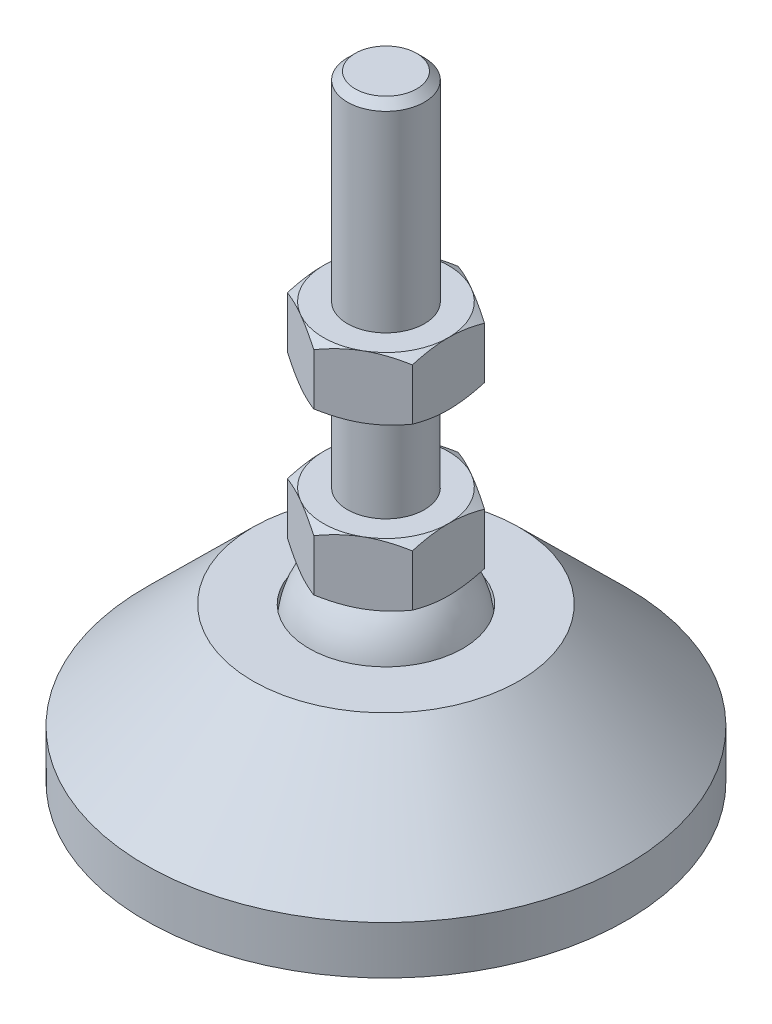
ISO-10303-21;
HEADER;
FILE_DESCRIPTION(('STEP AP214'),'2;1');
FILE_NAME('part.step','',(''),(''),'','','');
FILE_SCHEMA(('AUTOMOTIVE_DESIGN { 1 0 10303 214 1 1 1 1 }'));
ENDSEC;
DATA;
#1=APPLICATION_CONTEXT('core data for automotive mechanical design processes');
#2=APPLICATION_PROTOCOL_DEFINITION('international standard','automotive_design',2000,#1);
#3=PRODUCT_CONTEXT('',#1,'mechanical');
#4=PRODUCT('Part','Part','',(#3));
#5=PRODUCT_RELATED_PRODUCT_CATEGORY('part','',(#4));
#6=PRODUCT_DEFINITION_FORMATION('','',#4);
#7=PRODUCT_DEFINITION_CONTEXT('part definition',#1,'design');
#8=PRODUCT_DEFINITION('design','',#6,#7);
#9=PRODUCT_DEFINITION_SHAPE('','',#8);
#10=(LENGTH_UNIT() NAMED_UNIT(*) SI_UNIT(.MILLI.,.METRE.));
#11=(NAMED_UNIT(*) PLANE_ANGLE_UNIT() SI_UNIT($,.RADIAN.));
#12=(NAMED_UNIT(*) SI_UNIT($,.STERADIAN.) SOLID_ANGLE_UNIT());
#13=UNCERTAINTY_MEASURE_WITH_UNIT(LENGTH_MEASURE(1.E-05),#10,'distance_accuracy_value','');
#14=(GEOMETRIC_REPRESENTATION_CONTEXT(3) GLOBAL_UNCERTAINTY_ASSIGNED_CONTEXT((#13)) GLOBAL_UNIT_ASSIGNED_CONTEXT((#10,
#11,#12)) REPRESENTATION_CONTEXT('',''));
#15=CARTESIAN_POINT('',(0.,0.,0.));
#16=DIRECTION('',(0.,0.,1.));
#17=DIRECTION('',(1.,0.,0.));
#18=AXIS2_PLACEMENT_3D('',#15,#16,#17);
#19=CARTESIAN_POINT('',(-6.5,26.5,-11.2583302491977));
#20=DIRECTION('',(0.,-1.,0.));
#21=DIRECTION('',(-1.,0.,0.));
#22=AXIS2_PLACEMENT_3D('',#19,#20,#21);
#23=PLANE('',#22);
#24=CARTESIAN_POINT('',(0.,26.5,0.));
#25=DIRECTION('',(0.,1.,0.));
#26=DIRECTION('',(1.,0.,0.));
#27=AXIS2_PLACEMENT_3D('',#24,#25,#26);
#28=CIRCLE('',#27,4.);
#29=CARTESIAN_POINT('',(4.,26.5,0.));
#30=VERTEX_POINT('',#29);
#31=EDGE_CURVE('E328',#30,#30,#28,.T.);
#32=ORIENTED_EDGE('',*,*,#31,.F.);
#33=EDGE_LOOP('',(#32));
#34=FACE_BOUND('',#33,.T.);
#35=CARTESIAN_POINT('',(0.,26.5,0.));
#36=DIRECTION('',(0.,-1.,0.));
#37=DIRECTION('',(-1.,0.,0.));
#38=AXIS2_PLACEMENT_3D('',#35,#36,#37);
#39=CIRCLE('',#38,6.5);
#40=CARTESIAN_POINT('',(-6.5,26.5,0.));
#41=VERTEX_POINT('',#40);
#42=CARTESIAN_POINT('',(-3.25,26.5,-5.62916512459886));
#43=VERTEX_POINT('',#42);
#44=EDGE_CURVE('E336',#41,#43,#39,.T.);
#45=ORIENTED_EDGE('',*,*,#44,.F.);
#46=CARTESIAN_POINT('',(0.,26.5,0.));
#47=DIRECTION('',(0.,-1.,0.));
#48=DIRECTION('',(-1.,0.,0.));
#49=AXIS2_PLACEMENT_3D('',#46,#47,#48);
#50=CIRCLE('',#49,6.5);
#51=CARTESIAN_POINT('',(-3.25,26.5,5.62916512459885));
#52=VERTEX_POINT('',#51);
#53=EDGE_CURVE('E158',#41,#52,#50,.F.);
#54=ORIENTED_EDGE('',*,*,#53,.T.);
#55=CARTESIAN_POINT('',(3.25,26.5,5.62916512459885));
#56=VERTEX_POINT('',#55);
#57=EDGE_CURVE('E260',#52,#56,#50,.F.);
#58=ORIENTED_EDGE('',*,*,#57,.T.);
#59=CARTESIAN_POINT('',(6.5,26.5,0.));
#60=VERTEX_POINT('',#59);
#61=EDGE_CURVE('E161',#56,#60,#50,.F.);
#62=ORIENTED_EDGE('',*,*,#61,.T.);
#63=CARTESIAN_POINT('',(3.25,26.5,-5.62916512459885));
#64=VERTEX_POINT('',#63);
#65=EDGE_CURVE('E136',#60,#64,#50,.F.);
#66=ORIENTED_EDGE('',*,*,#65,.T.);
#67=EDGE_CURVE('E149',#64,#43,#50,.F.);
#68=ORIENTED_EDGE('',*,*,#67,.T.);
#69=EDGE_LOOP('',(#45,#54,#58,#62,#66,#68));
#70=FACE_BOUND('',#69,.T.);
#71=ADVANCED_FACE('F41',(#34,#70),#23,.F.);
#72=CARTESIAN_POINT('',(0.,26.5,0.));
#73=DIRECTION('',(0.,-1.,0.));
#74=DIRECTION('',(-1.,0.,0.));
#75=AXIS2_PLACEMENT_3D('',#72,#73,#74);
#76=CONICAL_SURFACE('',#75,6.5,1.0471975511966);
#77=CARTESIAN_POINT('',(-6.5,23.3190426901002,10.0985149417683));
#78=CARTESIAN_POINT('',(-6.5,23.4569246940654,9.81442448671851));
#79=CARTESIAN_POINT('',(-6.5,23.5934896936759,9.52968373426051));
#80=CARTESIAN_POINT('',(-6.5,23.8632451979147,8.95855580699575));
#81=CARTESIAN_POINT('',(-6.5,23.9964351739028,8.67216838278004));
#82=CARTESIAN_POINT('',(-6.5,24.2593661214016,8.09593488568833));
#83=CARTESIAN_POINT('',(-6.5,24.3890845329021,7.80607848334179));
#84=CARTESIAN_POINT('',(-6.5,24.6432356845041,7.22406608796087));
#85=CARTESIAN_POINT('',(-6.5,24.7676686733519,6.93191020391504));
#86=CARTESIAN_POINT('',(-6.5,25.0137381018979,6.33541861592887));
#87=CARTESIAN_POINT('',(-6.5,25.135157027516,6.03099269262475));
#88=CARTESIAN_POINT('',(-6.5,25.3688490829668,5.41858592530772));
#89=CARTESIAN_POINT('',(-6.5,25.4811211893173,5.11060468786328));
#90=CARTESIAN_POINT('',(-6.5,25.6935864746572,4.49116870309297));
#91=CARTESIAN_POINT('',(-6.5,25.7938039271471,4.17972236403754));
#92=CARTESIAN_POINT('',(-6.5,25.9789553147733,3.55235928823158));
#93=CARTESIAN_POINT('',(-6.5,26.0638940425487,3.23644398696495));
#94=CARTESIAN_POINT('',(-6.5,26.2139859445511,2.6016924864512));
#95=CARTESIAN_POINT('',(-6.5,26.2792444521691,2.28288159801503));
#96=CARTESIAN_POINT('',(-6.5,26.3862693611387,1.64123192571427));
#97=CARTESIAN_POINT('',(-6.5,26.4280380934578,1.31839354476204));
#98=CARTESIAN_POINT('',(-6.5,26.4703012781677,0.834548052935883));
#99=CARTESIAN_POINT('',(-6.5,26.4809857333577,0.674391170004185));
#100=CARTESIAN_POINT('',(-6.5,26.4955771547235,0.353761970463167));
#101=CARTESIAN_POINT('',(-6.5,26.4994842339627,0.193289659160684));
#102=CARTESIAN_POINT('',(-6.5,26.5004201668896,-0.127675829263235));
#103=CARTESIAN_POINT('',(-6.5,26.4974489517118,-0.288169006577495));
#104=CARTESIAN_POINT('',(-6.5,26.4847030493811,-0.608887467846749));
#105=CARTESIAN_POINT('',(-6.5,26.4749280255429,-0.769112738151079));
#106=CARTESIAN_POINT('',(-6.5,26.4435174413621,-1.15356140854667));
#107=CARTESIAN_POINT('',(-6.5,26.4186881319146,-1.37752936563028));
#108=CARTESIAN_POINT('',(-6.5,26.3570843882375,-1.82380504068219));
#109=CARTESIAN_POINT('',(-6.5,26.3203083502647,-2.04611253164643));
#110=CARTESIAN_POINT('',(-6.5,26.1940100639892,-2.71028289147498));
#111=CARTESIAN_POINT('',(-6.5,26.0885398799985,-3.14915331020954));
#112=CARTESIAN_POINT('',(-6.5,25.9055805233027,-3.80555173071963));
#113=CARTESIAN_POINT('',(-6.5,25.8395899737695,-4.02648029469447));
#114=CARTESIAN_POINT('',(-6.5,25.700744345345,-4.46619094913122));
#115=CARTESIAN_POINT('',(-6.5,25.6278892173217,-4.68497302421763));
#116=CARTESIAN_POINT('',(-6.5,25.4764845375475,-5.12046127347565));
#117=CARTESIAN_POINT('',(-6.5,25.3979368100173,-5.33716808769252));
#118=CARTESIAN_POINT('',(-6.5,25.2360724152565,-5.76878342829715));
#119=CARTESIAN_POINT('',(-6.5,25.1527558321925,-5.98369198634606));
#120=CARTESIAN_POINT('',(-6.5,24.9342529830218,-6.5321333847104));
#121=CARTESIAN_POINT('',(-6.5,24.7962072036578,-6.86452551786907));
#122=CARTESIAN_POINT('',(-6.5,24.5127417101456,-7.52616114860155));
#123=CARTESIAN_POINT('',(-6.5,24.3673213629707,-7.85540437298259));
#124=CARTESIAN_POINT('',(-6.5,24.0707462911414,-8.51141095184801));
#125=CARTESIAN_POINT('',(-6.5,23.919589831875,-8.83817351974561));
#126=CARTESIAN_POINT('',(-6.5,23.6128281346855,-9.48958511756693));
#127=CARTESIAN_POINT('',(-6.5,23.4572230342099,-9.81423421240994));
#128=CARTESIAN_POINT('',(-6.5,23.1422661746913,-10.4622514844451));
#129=CARTESIAN_POINT('',(-6.5,22.9829096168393,-10.7856173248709));
#130=CARTESIAN_POINT('',(-6.5,22.661342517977,-11.4309268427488));
#131=CARTESIAN_POINT('',(-6.5,22.4991319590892,-11.7528705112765));
#132=CARTESIAN_POINT('',(-6.5,22.0091038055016,-12.7168301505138));
#133=CARTESIAN_POINT('',(-6.5,21.677833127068,-13.357090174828));
#134=CARTESIAN_POINT('',(-6.5,21.0412335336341,-14.5727884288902));
#135=CARTESIAN_POINT('',(-6.5,20.7364798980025,-15.1485293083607));
#136=CARTESIAN_POINT('',(-6.5,20.1231655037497,-16.2980144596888));
#137=CARTESIAN_POINT('',(-6.5,19.814604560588,-16.8717586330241));
#138=CARTESIAN_POINT('',(-6.5,19.1955406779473,-18.0160290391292));
#139=CARTESIAN_POINT('',(-6.5,18.8850460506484,-18.5865597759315));
#140=CARTESIAN_POINT('',(-6.5,18.2618519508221,-19.7263670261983));
#141=CARTESIAN_POINT('',(-6.5,17.9491526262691,-20.2956436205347));
#142=CARTESIAN_POINT('',(-6.5,17.6356435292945,-20.8644710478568));
#143=B_SPLINE_CURVE_WITH_KNOTS('',3,(#77,#78,#79,#80,#81,#82,#83,#84,#85,#86,#87,#88,#89,#90,
#91,#92,#93,#94,#95,#96,#97,#98,#99,#100,#101,#102,#103,#104,#105,#106,#107,#108,#109,#110,#111,
#112,#113,#114,#115,#116,#117,#118,#119,#120,#121,#122,#123,#124,#125,#126,#127,#128,#129,#130,
#131,#132,#133,#134,#135,#136,#137,#138,#139,#140,#141,#142),.UNSPECIFIED.,.F.,.F.,(4,2,2,2,2,2,
2,2,2,2,2,2,2,2,2,2,2,2,2,2,2,2,2,2,2,2,2,2,2,2,2,2,4),(0.,0.947360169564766,1.89486782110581,
2.84750200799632,3.80009131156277,4.78321700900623,5.76645256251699,6.74767387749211,
7.72858686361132,8.70415257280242,9.67962145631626,10.1610384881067,10.6424474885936,
11.1238613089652,11.6052989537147,12.2809380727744,12.9566679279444,14.3088484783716,
15.0005111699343,15.6921788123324,16.3836257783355,17.0750605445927,18.1546874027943,
19.2344070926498,20.3144559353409,21.3944714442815,22.4759529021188,23.5574411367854,
25.7200319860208,27.6742871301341,29.628637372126,31.5772753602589,33.5257837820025),.UNSPECIFIED.);
#144=CARTESIAN_POINT('',(-6.5,25.9194434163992,-3.75277674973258));
#145=VERTEX_POINT('',#144);
#146=EDGE_CURVE('E166',#145,#41,#143,.F.);
#147=ORIENTED_EDGE('',*,*,#146,.T.);
#148=ORIENTED_EDGE('',*,*,#44,.T.);
#149=CARTESIAN_POINT('',(0.000199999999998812,25.9193767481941,-7.50566896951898));
#150=CARTESIAN_POINT('',(-0.142677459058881,25.9669955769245,-7.4231786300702));
#151=CARTESIAN_POINT('',(-0.286087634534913,26.0124532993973,-7.34038072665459));
#152=CARTESIAN_POINT('',(-0.574072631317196,26.098451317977,-7.17411251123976));
#153=CARTESIAN_POINT('',(-0.718647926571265,26.138989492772,-7.09064192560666));
#154=CARTESIAN_POINT('',(-1.15468865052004,26.2524289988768,-6.8388936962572));
#155=CARTESIAN_POINT('',(-1.44787528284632,26.3169521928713,-6.66962231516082));
#156=CARTESIAN_POINT('',(-1.88662374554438,26.3926134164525,-6.41631077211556));
#157=CARTESIAN_POINT('',(-2.03087463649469,26.414167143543,-6.33302748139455));
#158=CARTESIAN_POINT('',(-2.32002821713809,26.4503096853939,-6.16608458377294));
#159=CARTESIAN_POINT('',(-2.46493084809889,26.4648991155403,-6.08242501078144));
#160=CARTESIAN_POINT('',(-2.75498777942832,26.4867412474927,-5.91496056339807));
#161=CARTESIAN_POINT('',(-2.90014160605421,26.4940022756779,-5.83115596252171));
#162=CARTESIAN_POINT('',(-3.19057533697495,26.5010396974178,-5.66347396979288));
#163=CARTESIAN_POINT('',(-3.33585523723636,26.5008163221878,-5.57959658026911));
#164=CARTESIAN_POINT('',(-3.7338759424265,26.4899165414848,-5.34979921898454));
#165=CARTESIAN_POINT('',(-3.98648646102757,26.4716181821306,-5.20395446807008));
#166=CARTESIAN_POINT('',(-4.49002967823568,26.4135936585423,-4.91323365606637));
#167=CARTESIAN_POINT('',(-4.74096060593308,26.3738476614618,-4.76835861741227));
#168=CARTESIAN_POINT('',(-5.24551722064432,26.2744940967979,-4.47705272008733));
#169=CARTESIAN_POINT('',(-5.49907924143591,26.214465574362,-4.33065861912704));
#170=CARTESIAN_POINT('',(-6.00242193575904,26.0782250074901,-4.04005357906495));
#171=CARTESIAN_POINT('',(-6.25220905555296,26.0020449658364,-3.89583891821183));
#172=CARTESIAN_POINT('',(-6.5002,25.9193767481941,-3.75266127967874));
#173=B_SPLINE_CURVE_WITH_KNOTS('',3,(#149,#150,#151,#152,#153,#154,#155,#156,#157,#158,#159,
#160,#161,#162,#163,#164,#165,#166,#167,#168,#169,#170,#171,#172),.UNSPECIFIED.,.F.,.F.,(4,2,2,
2,2,2,2,2,2,2,2,4),(0.,0.515105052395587,1.03043143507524,2.06322554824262,2.56697389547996,
3.07067772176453,3.57380860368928,4.0769239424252,4.9527935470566,5.82947446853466,
6.72559912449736,7.61996451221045),.UNSPECIFIED.);
#174=EDGE_CURVE('E198',#43,#145,#173,.T.);
#175=ORIENTED_EDGE('',*,*,#174,.T.);
#176=EDGE_LOOP('',(#147,#148,#175));
#177=FACE_BOUND('',#176,.T.);
#178=ADVANCED_FACE('F185',(#177),#76,.T.);
#179=CARTESIAN_POINT('',(6.5002,25.9193767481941,-3.75266127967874));
#180=CARTESIAN_POINT('',(6.35732254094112,25.9669955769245,-3.83515161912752));
#181=CARTESIAN_POINT('',(6.21391236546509,26.0124532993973,-3.91794952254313));
#182=CARTESIAN_POINT('',(5.92592736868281,26.098451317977,-4.08421773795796));
#183=CARTESIAN_POINT('',(5.78135207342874,26.138989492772,-4.16768832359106));
#184=CARTESIAN_POINT('',(5.34531134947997,26.2524289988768,-4.41943655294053));
#185=CARTESIAN_POINT('',(5.05212471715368,26.3169521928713,-4.58870793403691));
#186=CARTESIAN_POINT('',(4.61337625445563,26.3926134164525,-4.84201947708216));
#187=CARTESIAN_POINT('',(4.46912536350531,26.414167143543,-4.92530276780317));
#188=CARTESIAN_POINT('',(4.17997178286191,26.4503096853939,-5.09224566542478));
#189=CARTESIAN_POINT('',(4.03506915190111,26.4648991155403,-5.17590523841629));
#190=CARTESIAN_POINT('',(3.74501222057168,26.4867412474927,-5.34336968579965));
#191=CARTESIAN_POINT('',(3.59985839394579,26.4940022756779,-5.42717428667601));
#192=CARTESIAN_POINT('',(3.30942466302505,26.5010396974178,-5.59485627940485));
#193=CARTESIAN_POINT('',(3.16414476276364,26.5008163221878,-5.67873366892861));
#194=CARTESIAN_POINT('',(2.7661240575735,26.4899165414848,-5.90853103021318));
#195=CARTESIAN_POINT('',(2.51351353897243,26.4716181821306,-6.05437578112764));
#196=CARTESIAN_POINT('',(2.00997032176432,26.4135936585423,-6.34509659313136));
#197=CARTESIAN_POINT('',(1.75903939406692,26.3738476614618,-6.48997163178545));
#198=CARTESIAN_POINT('',(1.25448277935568,26.2744940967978,-6.78127752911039));
#199=CARTESIAN_POINT('',(1.00092075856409,26.214465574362,-6.92767163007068));
#200=CARTESIAN_POINT('',(0.497578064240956,26.0782250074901,-7.21827667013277));
#201=CARTESIAN_POINT('',(0.247790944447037,26.0020449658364,-7.3624913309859));
#202=CARTESIAN_POINT('',(-0.000199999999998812,25.9193767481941,-7.50566896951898));
#203=B_SPLINE_CURVE_WITH_KNOTS('',3,(#179,#180,#181,#182,#183,#184,#185,#186,#187,#188,#189,
#190,#191,#192,#193,#194,#195,#196,#197,#198,#199,#200,#201,#202),.UNSPECIFIED.,.F.,.F.,(4,2,2,
2,2,2,2,2,2,2,2,4),(0.,0.515105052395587,1.03043143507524,2.06322554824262,2.56697389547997,
3.07067772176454,3.57380860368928,4.0769239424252,4.9527935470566,5.82947446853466,
6.72559912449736,7.61996451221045),.UNSPECIFIED.);
#204=CARTESIAN_POINT('',(0.,25.9194434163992,-7.50555349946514));
#205=VERTEX_POINT('',#204);
#206=EDGE_CURVE('E145',#64,#205,#203,.T.);
#207=ORIENTED_EDGE('',*,*,#206,.T.);
#208=EDGE_CURVE('E152',#205,#43,#173,.T.);
#209=ORIENTED_EDGE('',*,*,#208,.T.);
#210=ORIENTED_EDGE('',*,*,#67,.F.);
#211=EDGE_LOOP('',(#207,#209,#210));
#212=FACE_BOUND('',#211,.T.);
#213=ADVANCED_FACE('F150',(#212),#76,.T.);
#214=CARTESIAN_POINT('',(6.5,23.3190426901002,10.0985149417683));
#215=CARTESIAN_POINT('',(6.5,23.4569246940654,9.81442448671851));
#216=CARTESIAN_POINT('',(6.5,23.5934896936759,9.52968373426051));
#217=CARTESIAN_POINT('',(6.5,23.8632451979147,8.95855580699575));
#218=CARTESIAN_POINT('',(6.5,23.9964351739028,8.67216838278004));
#219=CARTESIAN_POINT('',(6.5,24.2593661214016,8.09593488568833));
#220=CARTESIAN_POINT('',(6.5,24.3890845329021,7.80607848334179));
#221=CARTESIAN_POINT('',(6.5,24.6432356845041,7.22406608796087));
#222=CARTESIAN_POINT('',(6.5,24.7676686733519,6.93191020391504));
#223=CARTESIAN_POINT('',(6.5,25.0137381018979,6.33541861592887));
#224=CARTESIAN_POINT('',(6.5,25.135157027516,6.03099269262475));
#225=CARTESIAN_POINT('',(6.5,25.3688490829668,5.41858592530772));
#226=CARTESIAN_POINT('',(6.5,25.4811211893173,5.11060468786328));
#227=CARTESIAN_POINT('',(6.5,25.6935864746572,4.49116870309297));
#228=CARTESIAN_POINT('',(6.5,25.7938039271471,4.17972236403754));
#229=CARTESIAN_POINT('',(6.5,25.9789553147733,3.55235928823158));
#230=CARTESIAN_POINT('',(6.5,26.0638940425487,3.23644398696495));
#231=CARTESIAN_POINT('',(6.5,26.2139859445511,2.6016924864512));
#232=CARTESIAN_POINT('',(6.5,26.2792444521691,2.28288159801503));
#233=CARTESIAN_POINT('',(6.5,26.3862693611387,1.64123192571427));
#234=CARTESIAN_POINT('',(6.5,26.4280380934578,1.31839354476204));
#235=CARTESIAN_POINT('',(6.5,26.4703012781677,0.834548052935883));
#236=CARTESIAN_POINT('',(6.5,26.4809857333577,0.674391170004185));
#237=CARTESIAN_POINT('',(6.5,26.4955771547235,0.353761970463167));
#238=CARTESIAN_POINT('',(6.5,26.4994842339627,0.193289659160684));
#239=CARTESIAN_POINT('',(6.5,26.5004201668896,-0.127675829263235));
#240=CARTESIAN_POINT('',(6.5,26.4974489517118,-0.288169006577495));
#241=CARTESIAN_POINT('',(6.5,26.4847030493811,-0.608887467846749));
#242=CARTESIAN_POINT('',(6.5,26.4749280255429,-0.769112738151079));
#243=CARTESIAN_POINT('',(6.5,26.4435174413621,-1.15356140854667));
#244=CARTESIAN_POINT('',(6.5,26.4186881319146,-1.37752936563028));
#245=CARTESIAN_POINT('',(6.5,26.3570843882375,-1.82380504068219));
#246=CARTESIAN_POINT('',(6.5,26.3203083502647,-2.04611253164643));
#247=CARTESIAN_POINT('',(6.5,26.1940100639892,-2.71028289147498));
#248=CARTESIAN_POINT('',(6.5,26.0885398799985,-3.14915331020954));
#249=CARTESIAN_POINT('',(6.5,25.9055805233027,-3.80555173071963));
#250=CARTESIAN_POINT('',(6.5,25.8395899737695,-4.02648029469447));
#251=CARTESIAN_POINT('',(6.5,25.700744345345,-4.46619094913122));
#252=CARTESIAN_POINT('',(6.5,25.6278892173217,-4.68497302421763));
#253=CARTESIAN_POINT('',(6.5,25.4764845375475,-5.12046127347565));
#254=CARTESIAN_POINT('',(6.5,25.3979368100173,-5.33716808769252));
#255=CARTESIAN_POINT('',(6.5,25.2360724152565,-5.76878342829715));
#256=CARTESIAN_POINT('',(6.5,25.1527558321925,-5.98369198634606));
#257=CARTESIAN_POINT('',(6.5,24.9342529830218,-6.5321333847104));
#258=CARTESIAN_POINT('',(6.5,24.7962072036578,-6.86452551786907));
#259=CARTESIAN_POINT('',(6.5,24.5127417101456,-7.52616114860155));
#260=CARTESIAN_POINT('',(6.5,24.3673213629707,-7.85540437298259));
#261=CARTESIAN_POINT('',(6.5,24.0707462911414,-8.51141095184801));
#262=CARTESIAN_POINT('',(6.5,23.919589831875,-8.83817351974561));
#263=CARTESIAN_POINT('',(6.5,23.6128281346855,-9.48958511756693));
#264=CARTESIAN_POINT('',(6.5,23.4572230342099,-9.81423421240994));
#265=CARTESIAN_POINT('',(6.5,23.1422661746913,-10.4622514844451));
#266=CARTESIAN_POINT('',(6.5,22.9829096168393,-10.7856173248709));
#267=CARTESIAN_POINT('',(6.5,22.661342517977,-11.4309268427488));
#268=CARTESIAN_POINT('',(6.5,22.4991319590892,-11.7528705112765));
#269=CARTESIAN_POINT('',(6.5,22.0091038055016,-12.7168301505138));
#270=CARTESIAN_POINT('',(6.5,21.677833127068,-13.357090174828));
#271=CARTESIAN_POINT('',(6.5,21.0412335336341,-14.5727884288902));
#272=CARTESIAN_POINT('',(6.5,20.7364798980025,-15.1485293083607));
#273=CARTESIAN_POINT('',(6.5,20.1231655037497,-16.2980144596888));
#274=CARTESIAN_POINT('',(6.5,19.814604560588,-16.8717586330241));
#275=CARTESIAN_POINT('',(6.5,19.1955406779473,-18.0160290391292));
#276=CARTESIAN_POINT('',(6.5,18.8850460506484,-18.5865597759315));
#277=CARTESIAN_POINT('',(6.5,18.2618519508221,-19.7263670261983));
#278=CARTESIAN_POINT('',(6.5,17.9491526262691,-20.2956436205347));
#279=CARTESIAN_POINT('',(6.5,17.6356435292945,-20.8644710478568));
#280=B_SPLINE_CURVE_WITH_KNOTS('',3,(#214,#215,#216,#217,#218,#219,#220,#221,#222,#223,#224,
#225,#226,#227,#228,#229,#230,#231,#232,#233,#234,#235,#236,#237,#238,#239,#240,#241,#242,#243,
#244,#245,#246,#247,#248,#249,#250,#251,#252,#253,#254,#255,#256,#257,#258,#259,#260,#261,#262,
#263,#264,#265,#266,#267,#268,#269,#270,#271,#272,#273,#274,#275,#276,#277,#278,#279),
.UNSPECIFIED.,.F.,.F.,(4,2,2,2,2,2,2,2,2,2,2,2,2,2,2,2,2,2,2,2,2,2,2,2,2,2,2,2,2,2,2,2,4),(0.,
0.947360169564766,1.89486782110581,2.84750200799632,3.80009131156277,4.78321700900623,
5.76645256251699,6.74767387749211,7.72858686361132,8.70415257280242,9.67962145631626,
10.1610384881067,10.6424474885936,11.1238613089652,11.6052989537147,12.2809380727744,
12.9566679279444,14.3088484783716,15.0005111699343,15.6921788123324,16.3836257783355,
17.0750605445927,18.1546874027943,19.2344070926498,20.3144559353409,21.3944714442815,
22.4759529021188,23.5574411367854,25.7200319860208,27.6742871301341,29.628637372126,
31.5772753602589,33.5257837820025),.UNSPECIFIED.);
#281=CARTESIAN_POINT('',(6.5,25.9194434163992,-3.75277674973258));
#282=VERTEX_POINT('',#281);
#283=EDGE_CURVE('E139',#60,#282,#280,.T.);
#284=ORIENTED_EDGE('',*,*,#283,.T.);
#285=EDGE_CURVE('E132',#282,#64,#203,.T.);
#286=ORIENTED_EDGE('',*,*,#285,.T.);
#287=ORIENTED_EDGE('',*,*,#65,.F.);
#288=EDGE_LOOP('',(#284,#286,#287));
#289=FACE_BOUND('',#288,.T.);
#290=ADVANCED_FACE('F134',(#289),#76,.T.);
#291=CARTESIAN_POINT('',(-0.000199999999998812,25.9193767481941,7.50566896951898));
#292=CARTESIAN_POINT('',(0.142677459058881,25.9669955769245,7.4231786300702));
#293=CARTESIAN_POINT('',(0.286087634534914,26.0124532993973,7.34038072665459));
#294=CARTESIAN_POINT('',(0.574072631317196,26.098451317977,7.17411251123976));
#295=CARTESIAN_POINT('',(0.718647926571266,26.138989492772,7.09064192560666));
#296=CARTESIAN_POINT('',(1.15468865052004,26.2524289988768,6.8388936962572));
#297=CARTESIAN_POINT('',(1.44787528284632,26.3169521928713,6.66962231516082));
#298=CARTESIAN_POINT('',(1.88662374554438,26.3926134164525,6.41631077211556));
#299=CARTESIAN_POINT('',(2.03087463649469,26.414167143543,6.33302748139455));
#300=CARTESIAN_POINT('',(2.32002821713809,26.4503096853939,6.16608458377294));
#301=CARTESIAN_POINT('',(2.46493084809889,26.4648991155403,6.08242501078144));
#302=CARTESIAN_POINT('',(2.75498777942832,26.4867412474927,5.91496056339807));
#303=CARTESIAN_POINT('',(2.90014160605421,26.4940022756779,5.83115596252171));
#304=CARTESIAN_POINT('',(3.19057533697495,26.5010396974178,5.66347396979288));
#305=CARTESIAN_POINT('',(3.33585523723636,26.5008163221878,5.57959658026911));
#306=CARTESIAN_POINT('',(3.73387594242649,26.4899165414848,5.34979921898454));
#307=CARTESIAN_POINT('',(3.98648646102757,26.4716181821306,5.20395446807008));
#308=CARTESIAN_POINT('',(4.49002967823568,26.4135936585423,4.91323365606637));
#309=CARTESIAN_POINT('',(4.74096060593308,26.3738476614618,4.76835861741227));
#310=CARTESIAN_POINT('',(5.24551722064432,26.2744940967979,4.47705272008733));
#311=CARTESIAN_POINT('',(5.49907924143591,26.214465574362,4.33065861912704));
#312=CARTESIAN_POINT('',(6.00242193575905,26.0782250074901,4.04005357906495));
#313=CARTESIAN_POINT('',(6.25220905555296,26.0020449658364,3.89583891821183));
#314=CARTESIAN_POINT('',(6.5002,25.9193767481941,3.75266127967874));
#315=B_SPLINE_CURVE_WITH_KNOTS('',3,(#291,#292,#293,#294,#295,#296,#297,#298,#299,#300,#301,
#302,#303,#304,#305,#306,#307,#308,#309,#310,#311,#312,#313,#314),.UNSPECIFIED.,.F.,.F.,(4,2,2,
2,2,2,2,2,2,2,2,4),(0.,0.515105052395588,1.03043143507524,2.06322554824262,2.56697389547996,
3.07067772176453,3.57380860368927,4.0769239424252,4.9527935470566,5.82947446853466,
6.72559912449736,7.61996451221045),.UNSPECIFIED.);
#316=CARTESIAN_POINT('',(6.5,25.9194434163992,3.75277674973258));
#317=VERTEX_POINT('',#316);
#318=EDGE_CURVE('E212',#56,#317,#315,.T.);
#319=ORIENTED_EDGE('',*,*,#318,.T.);
#320=EDGE_CURVE('E211',#317,#60,#280,.T.);
#321=ORIENTED_EDGE('',*,*,#320,.T.);
#322=ORIENTED_EDGE('',*,*,#61,.F.);
#323=EDGE_LOOP('',(#319,#321,#322));
#324=FACE_BOUND('',#323,.T.);
#325=ADVANCED_FACE('F435',(#324),#76,.T.);
#326=CARTESIAN_POINT('',(0.,25.9194434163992,7.50555349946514));
#327=VERTEX_POINT('',#326);
#328=EDGE_CURVE('E270',#327,#56,#315,.T.);
#329=ORIENTED_EDGE('',*,*,#328,.T.);
#330=ORIENTED_EDGE('',*,*,#57,.F.);
#331=CARTESIAN_POINT('',(-6.5002,25.9193767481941,3.75266127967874));
#332=CARTESIAN_POINT('',(-6.35732254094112,25.9669955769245,3.83515161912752));
#333=CARTESIAN_POINT('',(-6.21391236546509,26.0124532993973,3.91794952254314));
#334=CARTESIAN_POINT('',(-5.9259273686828,26.098451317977,4.08421773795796));
#335=CARTESIAN_POINT('',(-5.78135207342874,26.138989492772,4.16768832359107));
#336=CARTESIAN_POINT('',(-5.34531134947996,26.2524289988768,4.41943655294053));
#337=CARTESIAN_POINT('',(-5.05212471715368,26.3169521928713,4.58870793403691));
#338=CARTESIAN_POINT('',(-4.61337625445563,26.3926134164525,4.84201947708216));
#339=CARTESIAN_POINT('',(-4.46912536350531,26.414167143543,4.92530276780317));
#340=CARTESIAN_POINT('',(-4.17997178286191,26.4503096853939,5.09224566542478));
#341=CARTESIAN_POINT('',(-4.03506915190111,26.4648991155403,5.17590523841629));
#342=CARTESIAN_POINT('',(-3.74501222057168,26.4867412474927,5.34336968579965));
#343=CARTESIAN_POINT('',(-3.59985839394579,26.4940022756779,5.42717428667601));
#344=CARTESIAN_POINT('',(-3.30942466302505,26.5010396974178,5.59485627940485));
#345=CARTESIAN_POINT('',(-3.16414476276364,26.5008163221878,5.67873366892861));
#346=CARTESIAN_POINT('',(-2.7661240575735,26.4899165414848,5.90853103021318));
#347=CARTESIAN_POINT('',(-2.51351353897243,26.4716181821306,6.05437578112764));
#348=CARTESIAN_POINT('',(-2.00997032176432,26.4135936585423,6.34509659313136));
#349=CARTESIAN_POINT('',(-1.75903939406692,26.3738476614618,6.48997163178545));
#350=CARTESIAN_POINT('',(-1.25448277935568,26.2744940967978,6.78127752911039));
#351=CARTESIAN_POINT('',(-1.00092075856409,26.214465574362,6.92767163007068));
#352=CARTESIAN_POINT('',(-0.497578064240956,26.0782250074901,7.21827667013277));
#353=CARTESIAN_POINT('',(-0.247790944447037,26.0020449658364,7.3624913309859));
#354=CARTESIAN_POINT('',(0.000199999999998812,25.9193767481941,7.50566896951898));
#355=B_SPLINE_CURVE_WITH_KNOTS('',3,(#331,#332,#333,#334,#335,#336,#337,#338,#339,#340,#341,
#342,#343,#344,#345,#346,#347,#348,#349,#350,#351,#352,#353,#354),.UNSPECIFIED.,.F.,.F.,(4,2,2,
2,2,2,2,2,2,2,2,4),(0.,0.515105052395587,1.03043143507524,2.06322554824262,2.56697389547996,
3.07067772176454,3.57380860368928,4.0769239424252,4.9527935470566,5.82947446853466,
6.72559912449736,7.61996451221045),.UNSPECIFIED.);
#356=EDGE_CURVE('E274',#52,#327,#355,.T.);
#357=ORIENTED_EDGE('',*,*,#356,.T.);
#358=EDGE_LOOP('',(#329,#330,#357));
#359=FACE_BOUND('',#358,.T.);
#360=ADVANCED_FACE('F191',(#359),#76,.T.);
#361=CARTESIAN_POINT('',(-6.5,25.9194434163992,3.75277674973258));
#362=VERTEX_POINT('',#361);
#363=EDGE_CURVE('E179',#362,#52,#355,.T.);
#364=ORIENTED_EDGE('',*,*,#363,.T.);
#365=ORIENTED_EDGE('',*,*,#53,.F.);
#366=EDGE_CURVE('E144',#41,#362,#143,.F.);
#367=ORIENTED_EDGE('',*,*,#366,.T.);
#368=EDGE_LOOP('',(#364,#365,#367));
#369=FACE_BOUND('',#368,.T.);
#370=ADVANCED_FACE('F279',(#369),#76,.T.);
#371=CARTESIAN_POINT('',(6.5,20.,-3.75277674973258));
#372=DIRECTION('',(0.5,0.,-0.866025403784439));
#373=DIRECTION('',(-0.866025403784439,0.,-0.5));
#374=AXIS2_PLACEMENT_3D('',#371,#372,#373);
#375=PLANE('',#374);
#376=CARTESIAN_POINT('',(-0.000199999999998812,20.5806232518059,-7.50566896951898));
#377=CARTESIAN_POINT('',(0.142677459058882,20.5330044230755,-7.4231786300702));
#378=CARTESIAN_POINT('',(0.286087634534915,20.4875467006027,-7.34038072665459));
#379=CARTESIAN_POINT('',(0.574072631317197,20.401548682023,-7.17411251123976));
#380=CARTESIAN_POINT('',(0.718647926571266,20.361010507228,-7.09064192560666));
#381=CARTESIAN_POINT('',(1.15468865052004,20.2475710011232,-6.8388936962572));
#382=CARTESIAN_POINT('',(1.44787528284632,20.1830478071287,-6.66962231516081));
#383=CARTESIAN_POINT('',(1.88662374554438,20.1073865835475,-6.41631077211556));
#384=CARTESIAN_POINT('',(2.03087463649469,20.085832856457,-6.33302748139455));
#385=CARTESIAN_POINT('',(2.32002821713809,20.0496903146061,-6.16608458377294));
#386=CARTESIAN_POINT('',(2.46493084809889,20.0351008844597,-6.08242501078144));
#387=CARTESIAN_POINT('',(2.75498777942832,20.0132587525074,-5.91496056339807));
#388=CARTESIAN_POINT('',(2.90014160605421,20.0059977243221,-5.83115596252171));
#389=CARTESIAN_POINT('',(3.19057533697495,19.9989603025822,-5.66347396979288));
#390=CARTESIAN_POINT('',(3.33585523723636,19.9991836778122,-5.57959658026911));
#391=CARTESIAN_POINT('',(3.73387594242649,20.0100834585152,-5.34979921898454));
#392=CARTESIAN_POINT('',(3.98648646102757,20.0283818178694,-5.20395446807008));
#393=CARTESIAN_POINT('',(4.49002967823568,20.0864063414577,-4.91323365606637));
#394=CARTESIAN_POINT('',(4.74096060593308,20.1261523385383,-4.76835861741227));
#395=CARTESIAN_POINT('',(5.24551722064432,20.2255059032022,-4.47705272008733));
#396=CARTESIAN_POINT('',(5.49907924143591,20.285534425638,-4.33065861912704));
#397=CARTESIAN_POINT('',(6.00242193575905,20.4217749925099,-4.04005357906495));
#398=CARTESIAN_POINT('',(6.25220905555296,20.4979550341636,-3.89583891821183));
#399=CARTESIAN_POINT('',(6.5002,20.5806232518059,-3.75266127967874));
#400=B_SPLINE_CURVE_WITH_KNOTS('',3,(#376,#377,#378,#379,#380,#381,#382,#383,#384,#385,#386,
#387,#388,#389,#390,#391,#392,#393,#394,#395,#396,#397,#398,#399),.UNSPECIFIED.,.F.,.F.,(4,2,2,
2,2,2,2,2,2,2,2,4),(0.,0.515105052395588,1.03043143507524,2.06322554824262,2.56697389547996,
3.07067772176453,3.57380860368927,4.0769239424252,4.9527935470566,5.82947446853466,
6.72559912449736,7.61996451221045),.UNSPECIFIED.);
#401=CARTESIAN_POINT('',(0.,20.5805565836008,-7.50555349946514));
#402=VERTEX_POINT('',#401);
#403=CARTESIAN_POINT('',(3.25,20.,-5.62916512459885));
#404=VERTEX_POINT('',#403);
#405=EDGE_CURVE('E245',#402,#404,#400,.T.);
#406=ORIENTED_EDGE('',*,*,#405,.F.);
#407=DIRECTION('',(0.,1.,0.));
#408=VECTOR('',#407,1.);
#409=CARTESIAN_POINT('',(0.,20.,-7.50555349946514));
#410=LINE('',#409,#408);
#411=EDGE_CURVE('E165',#402,#205,#410,.T.);
#412=ORIENTED_EDGE('',*,*,#411,.T.);
#413=ORIENTED_EDGE('',*,*,#206,.F.);
#414=ORIENTED_EDGE('',*,*,#285,.F.);
#415=DIRECTION('',(0.,1.,0.));
#416=VECTOR('',#415,1.);
#417=CARTESIAN_POINT('',(6.5,20.,-3.75277674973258));
#418=LINE('',#417,#416);
#419=CARTESIAN_POINT('',(6.5,20.5805565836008,-3.75277674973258));
#420=VERTEX_POINT('',#419);
#421=EDGE_CURVE('E157',#420,#282,#418,.T.);
#422=ORIENTED_EDGE('',*,*,#421,.F.);
#423=EDGE_CURVE('E240',#404,#420,#400,.T.);
#424=ORIENTED_EDGE('',*,*,#423,.F.);
#425=EDGE_LOOP('',(#406,#412,#413,#414,#422,#424));
#426=FACE_BOUND('',#425,.T.);
#427=ADVANCED_FACE('F43',(#426),#375,.T.);
#428=CARTESIAN_POINT('',(6.5,20.,3.75277674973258));
#429=DIRECTION('',(1.,0.,0.));
#430=DIRECTION('',(0.,-1.,0.));
#431=AXIS2_PLACEMENT_3D('',#428,#429,#430);
#432=PLANE('',#431);
#433=CARTESIAN_POINT('',(6.5,23.1809573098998,10.0985149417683));
#434=CARTESIAN_POINT('',(6.5,23.0430753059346,9.81442448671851));
#435=CARTESIAN_POINT('',(6.5,22.9065103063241,9.52968373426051));
#436=CARTESIAN_POINT('',(6.5,22.6367548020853,8.95855580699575));
#437=CARTESIAN_POINT('',(6.5,22.5035648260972,8.67216838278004));
#438=CARTESIAN_POINT('',(6.5,22.2406338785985,8.09593488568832));
#439=CARTESIAN_POINT('',(6.5,22.1109154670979,7.80607848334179));
#440=CARTESIAN_POINT('',(6.5,21.8567643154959,7.22406608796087));
#441=CARTESIAN_POINT('',(6.5,21.7323313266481,6.93191020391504));
#442=CARTESIAN_POINT('',(6.5,21.4862618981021,6.33541861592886));
#443=CARTESIAN_POINT('',(6.5,21.364842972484,6.03099269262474));
#444=CARTESIAN_POINT('',(6.5,21.1311509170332,5.41858592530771));
#445=CARTESIAN_POINT('',(6.5,21.0188788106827,5.11060468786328));
#446=CARTESIAN_POINT('',(6.5,20.8064135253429,4.49116870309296));
#447=CARTESIAN_POINT('',(6.5,20.7061960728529,4.17972236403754));
#448=CARTESIAN_POINT('',(6.5,20.5210446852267,3.55235928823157));
#449=CARTESIAN_POINT('',(6.5,20.4361059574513,3.23644398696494));
#450=CARTESIAN_POINT('',(6.5,20.2860140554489,2.60169248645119));
#451=CARTESIAN_POINT('',(6.5,20.2207555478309,2.28288159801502));
#452=CARTESIAN_POINT('',(6.5,20.1137306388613,1.64123192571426));
#453=CARTESIAN_POINT('',(6.5,20.0719619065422,1.31839354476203));
#454=CARTESIAN_POINT('',(6.5,20.0296987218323,0.83454805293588));
#455=CARTESIAN_POINT('',(6.5,20.0190142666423,0.674391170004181));
#456=CARTESIAN_POINT('',(6.5,20.0044228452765,0.353761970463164));
#457=CARTESIAN_POINT('',(6.5,20.0005157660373,0.193289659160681));
#458=CARTESIAN_POINT('',(6.5,19.9995798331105,-0.127675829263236));
#459=CARTESIAN_POINT('',(6.5,20.0025510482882,-0.288169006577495));
#460=CARTESIAN_POINT('',(6.5,20.0152969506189,-0.608887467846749));
#461=CARTESIAN_POINT('',(6.5,20.0250719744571,-0.769112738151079));
#462=CARTESIAN_POINT('',(6.5,20.0564825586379,-1.15356140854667));
#463=CARTESIAN_POINT('',(6.5,20.0813118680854,-1.37752936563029));
#464=CARTESIAN_POINT('',(6.5,20.1429156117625,-1.82380504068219));
#465=CARTESIAN_POINT('',(6.5,20.1796916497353,-2.04611253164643));
#466=CARTESIAN_POINT('',(6.5,20.3059899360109,-2.71028289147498));
#467=CARTESIAN_POINT('',(6.5,20.4114601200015,-3.14915331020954));
#468=CARTESIAN_POINT('',(6.5,20.5944194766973,-3.80555173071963));
#469=CARTESIAN_POINT('',(6.5,20.6604100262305,-4.02648029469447));
#470=CARTESIAN_POINT('',(6.5,20.799255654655,-4.46619094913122));
#471=CARTESIAN_POINT('',(6.5,20.8721107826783,-4.68497302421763));
#472=CARTESIAN_POINT('',(6.5,21.0235154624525,-5.12046127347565));
#473=CARTESIAN_POINT('',(6.5,21.1020631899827,-5.33716808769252));
#474=CARTESIAN_POINT('',(6.5,21.2639275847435,-5.76878342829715));
#475=CARTESIAN_POINT('',(6.5,21.3472441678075,-5.98369198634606));
#476=CARTESIAN_POINT('',(6.5,21.5657470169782,-6.5321333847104));
#477=CARTESIAN_POINT('',(6.5,21.7037927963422,-6.86452551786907));
#478=CARTESIAN_POINT('',(6.5,21.9872582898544,-7.52616114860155));
#479=CARTESIAN_POINT('',(6.5,22.1326786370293,-7.85540437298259));
#480=CARTESIAN_POINT('',(6.5,22.4292537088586,-8.51141095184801));
#481=CARTESIAN_POINT('',(6.5,22.580410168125,-8.8381735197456));
#482=CARTESIAN_POINT('',(6.5,22.8871718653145,-9.48958511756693));
#483=CARTESIAN_POINT('',(6.5,23.0427769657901,-9.81423421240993));
#484=CARTESIAN_POINT('',(6.5,23.3577338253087,-10.4622514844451));
#485=CARTESIAN_POINT('',(6.5,23.5170903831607,-10.7856173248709));
#486=CARTESIAN_POINT('',(6.5,23.838657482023,-11.4309268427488));
#487=CARTESIAN_POINT('',(6.5,24.0008680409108,-11.7528705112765));
#488=CARTESIAN_POINT('',(6.5,24.4908961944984,-12.7168301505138));
#489=CARTESIAN_POINT('',(6.5,24.822166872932,-13.357090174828));
#490=CARTESIAN_POINT('',(6.5,25.4587664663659,-14.5727884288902));
#491=CARTESIAN_POINT('',(6.5,25.7635201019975,-15.1485293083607));
#492=CARTESIAN_POINT('',(6.5,26.3768344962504,-16.2980144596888));
#493=CARTESIAN_POINT('',(6.5,26.685395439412,-16.8717586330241));
#494=CARTESIAN_POINT('',(6.5,27.3044593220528,-18.0160290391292));
#495=CARTESIAN_POINT('',(6.5,27.6149539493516,-18.5865597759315));
#496=CARTESIAN_POINT('',(6.5,28.2381480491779,-19.7263670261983));
#497=CARTESIAN_POINT('',(6.5,28.5508473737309,-20.2956436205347));
#498=CARTESIAN_POINT('',(6.5,28.8643564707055,-20.8644710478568));
#499=B_SPLINE_CURVE_WITH_KNOTS('',3,(#433,#434,#435,#436,#437,#438,#439,#440,#441,#442,#443,
#444,#445,#446,#447,#448,#449,#450,#451,#452,#453,#454,#455,#456,#457,#458,#459,#460,#461,#462,
#463,#464,#465,#466,#467,#468,#469,#470,#471,#472,#473,#474,#475,#476,#477,#478,#479,#480,#481,
#482,#483,#484,#485,#486,#487,#488,#489,#490,#491,#492,#493,#494,#495,#496,#497,#498),
.UNSPECIFIED.,.F.,.F.,(4,2,2,2,2,2,2,2,2,2,2,2,2,2,2,2,2,2,2,2,2,2,2,2,2,2,2,2,2,2,2,2,4),(0.,
0.947360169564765,1.89486782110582,2.84750200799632,3.80009131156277,4.78321700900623,
5.76645256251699,6.74767387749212,7.72858686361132,8.70415257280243,9.67962145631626,
10.1610384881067,10.6424474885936,11.1238613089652,11.6052989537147,12.2809380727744,
12.9566679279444,14.3088484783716,15.0005111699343,15.6921788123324,16.3836257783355,
17.0750605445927,18.1546874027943,19.2344070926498,20.3144559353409,21.3944714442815,
22.4759529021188,23.5574411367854,25.7200319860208,27.6742871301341,29.628637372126,
31.577275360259,33.5257837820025),.UNSPECIFIED.);
#500=CARTESIAN_POINT('',(6.5,20.,0.));
#501=VERTEX_POINT('',#500);
#502=EDGE_CURVE('E234',#420,#501,#499,.F.);
#503=ORIENTED_EDGE('',*,*,#502,.F.);
#504=ORIENTED_EDGE('',*,*,#421,.T.);
#505=ORIENTED_EDGE('',*,*,#283,.F.);
#506=ORIENTED_EDGE('',*,*,#320,.F.);
#507=DIRECTION('',(0.,1.,0.));
#508=VECTOR('',#507,1.);
#509=CARTESIAN_POINT('',(6.5,20.,3.75277674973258));
#510=LINE('',#509,#508);
#511=CARTESIAN_POINT('',(6.5,20.5805565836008,3.75277674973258));
#512=VERTEX_POINT('',#511);
#513=EDGE_CURVE('E247',#512,#317,#510,.T.);
#514=ORIENTED_EDGE('',*,*,#513,.F.);
#515=EDGE_CURVE('E228',#501,#512,#499,.F.);
#516=ORIENTED_EDGE('',*,*,#515,.F.);
#517=EDGE_LOOP('',(#503,#504,#505,#506,#514,#516));
#518=FACE_BOUND('',#517,.T.);
#519=ADVANCED_FACE('F218',(#518),#432,.T.);
#520=CARTESIAN_POINT('',(6.5,20.,3.75277674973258));
#521=DIRECTION('',(0.5,0.,0.866025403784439));
#522=DIRECTION('',(0.866025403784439,0.,-0.5));
#523=AXIS2_PLACEMENT_3D('',#520,#521,#522);
#524=PLANE('',#523);
#525=CARTESIAN_POINT('',(6.5002,20.5806232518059,3.75266127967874));
#526=CARTESIAN_POINT('',(6.35732254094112,20.5330044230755,3.83515161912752));
#527=CARTESIAN_POINT('',(6.21391236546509,20.4875467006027,3.91794952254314));
#528=CARTESIAN_POINT('',(5.9259273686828,20.401548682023,4.08421773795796));
#529=CARTESIAN_POINT('',(5.78135207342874,20.361010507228,4.16768832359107));
#530=CARTESIAN_POINT('',(5.34531134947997,20.2475710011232,4.41943655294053));
#531=CARTESIAN_POINT('',(5.05212471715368,20.1830478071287,4.58870793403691));
#532=CARTESIAN_POINT('',(4.61337625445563,20.1073865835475,4.84201947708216));
#533=CARTESIAN_POINT('',(4.46912536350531,20.085832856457,4.92530276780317));
#534=CARTESIAN_POINT('',(4.17997178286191,20.0496903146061,5.09224566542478));
#535=CARTESIAN_POINT('',(4.03506915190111,20.0351008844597,5.17590523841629));
#536=CARTESIAN_POINT('',(3.74501222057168,20.0132587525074,5.34336968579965));
#537=CARTESIAN_POINT('',(3.59985839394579,20.0059977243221,5.42717428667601));
#538=CARTESIAN_POINT('',(3.30942466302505,19.9989603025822,5.59485627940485));
#539=CARTESIAN_POINT('',(3.16414476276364,19.9991836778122,5.67873366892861));
#540=CARTESIAN_POINT('',(2.7661240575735,20.0100834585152,5.90853103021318));
#541=CARTESIAN_POINT('',(2.51351353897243,20.0283818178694,6.05437578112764));
#542=CARTESIAN_POINT('',(2.00997032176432,20.0864063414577,6.34509659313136));
#543=CARTESIAN_POINT('',(1.75903939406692,20.1261523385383,6.48997163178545));
#544=CARTESIAN_POINT('',(1.25448277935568,20.2255059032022,6.78127752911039));
#545=CARTESIAN_POINT('',(1.00092075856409,20.285534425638,6.92767163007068));
#546=CARTESIAN_POINT('',(0.497578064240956,20.4217749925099,7.21827667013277));
#547=CARTESIAN_POINT('',(0.247790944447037,20.4979550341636,7.36249133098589));
#548=CARTESIAN_POINT('',(-0.000199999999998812,20.5806232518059,7.50566896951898));
#549=B_SPLINE_CURVE_WITH_KNOTS('',3,(#525,#526,#527,#528,#529,#530,#531,#532,#533,#534,#535,
#536,#537,#538,#539,#540,#541,#542,#543,#544,#545,#546,#547,#548),.UNSPECIFIED.,.F.,.F.,(4,2,2,
2,2,2,2,2,2,2,2,4),(0.,0.515105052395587,1.03043143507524,2.06322554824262,2.56697389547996,
3.07067772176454,3.57380860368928,4.0769239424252,4.9527935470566,5.82947446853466,
6.72559912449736,7.61996451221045),.UNSPECIFIED.);
#550=CARTESIAN_POINT('',(3.25,20.,5.62916512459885));
#551=VERTEX_POINT('',#550);
#552=EDGE_CURVE('E65',#512,#551,#549,.T.);
#553=ORIENTED_EDGE('',*,*,#552,.F.);
#554=ORIENTED_EDGE('',*,*,#513,.T.);
#555=ORIENTED_EDGE('',*,*,#318,.F.);
#556=ORIENTED_EDGE('',*,*,#328,.F.);
#557=DIRECTION('',(0.,1.,0.));
#558=VECTOR('',#557,1.);
#559=CARTESIAN_POINT('',(0.,20.,7.50555349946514));
#560=LINE('',#559,#558);
#561=CARTESIAN_POINT('',(0.,20.5805565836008,7.50555349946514));
#562=VERTEX_POINT('',#561);
#563=EDGE_CURVE('E250',#562,#327,#560,.T.);
#564=ORIENTED_EDGE('',*,*,#563,.F.);
#565=EDGE_CURVE('E235',#551,#562,#549,.T.);
#566=ORIENTED_EDGE('',*,*,#565,.F.);
#567=EDGE_LOOP('',(#553,#554,#555,#556,#564,#566));
#568=FACE_BOUND('',#567,.T.);
#569=ADVANCED_FACE('F222',(#568),#524,.T.);
#570=CARTESIAN_POINT('',(-6.5,20.,3.75277674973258));
#571=DIRECTION('',(-0.5,0.,0.866025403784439));
#572=DIRECTION('',(0.866025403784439,0.,0.5));
#573=AXIS2_PLACEMENT_3D('',#570,#571,#572);
#574=PLANE('',#573);
#575=CARTESIAN_POINT('',(0.000199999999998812,20.5806232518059,7.50566896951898));
#576=CARTESIAN_POINT('',(-0.142677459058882,20.5330044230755,7.4231786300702));
#577=CARTESIAN_POINT('',(-0.286087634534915,20.4875467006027,7.34038072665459));
#578=CARTESIAN_POINT('',(-0.574072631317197,20.401548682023,7.17411251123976));
#579=CARTESIAN_POINT('',(-0.718647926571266,20.361010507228,7.09064192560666));
#580=CARTESIAN_POINT('',(-1.15468865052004,20.2475710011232,6.8388936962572));
#581=CARTESIAN_POINT('',(-1.44787528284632,20.1830478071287,6.66962231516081));
#582=CARTESIAN_POINT('',(-1.88662374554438,20.1073865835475,6.41631077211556));
#583=CARTESIAN_POINT('',(-2.03087463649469,20.085832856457,6.33302748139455));
#584=CARTESIAN_POINT('',(-2.32002821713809,20.0496903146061,6.16608458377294));
#585=CARTESIAN_POINT('',(-2.46493084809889,20.0351008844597,6.08242501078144));
#586=CARTESIAN_POINT('',(-2.75498777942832,20.0132587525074,5.91496056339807));
#587=CARTESIAN_POINT('',(-2.90014160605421,20.0059977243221,5.83115596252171));
#588=CARTESIAN_POINT('',(-3.19057533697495,19.9989603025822,5.66347396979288));
#589=CARTESIAN_POINT('',(-3.33585523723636,19.9991836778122,5.57959658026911));
#590=CARTESIAN_POINT('',(-3.73387594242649,20.0100834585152,5.34979921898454));
#591=CARTESIAN_POINT('',(-3.98648646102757,20.0283818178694,5.20395446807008));
#592=CARTESIAN_POINT('',(-4.49002967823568,20.0864063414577,4.91323365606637));
#593=CARTESIAN_POINT('',(-4.74096060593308,20.1261523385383,4.76835861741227));
#594=CARTESIAN_POINT('',(-5.24551722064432,20.2255059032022,4.47705272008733));
#595=CARTESIAN_POINT('',(-5.49907924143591,20.285534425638,4.33065861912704));
#596=CARTESIAN_POINT('',(-6.00242193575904,20.4217749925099,4.04005357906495));
#597=CARTESIAN_POINT('',(-6.25220905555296,20.4979550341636,3.89583891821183));
#598=CARTESIAN_POINT('',(-6.5002,20.5806232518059,3.75266127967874));
#599=B_SPLINE_CURVE_WITH_KNOTS('',3,(#575,#576,#577,#578,#579,#580,#581,#582,#583,#584,#585,
#586,#587,#588,#589,#590,#591,#592,#593,#594,#595,#596,#597,#598),.UNSPECIFIED.,.F.,.F.,(4,2,2,
2,2,2,2,2,2,2,2,4),(0.,0.515105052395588,1.03043143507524,2.06322554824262,2.56697389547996,
3.07067772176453,3.57380860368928,4.0769239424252,4.9527935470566,5.82947446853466,
6.72559912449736,7.61996451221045),.UNSPECIFIED.);
#600=CARTESIAN_POINT('',(-3.25,20.,5.62916512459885));
#601=VERTEX_POINT('',#600);
#602=EDGE_CURVE('E58',#562,#601,#599,.T.);
#603=ORIENTED_EDGE('',*,*,#602,.F.);
#604=ORIENTED_EDGE('',*,*,#563,.T.);
#605=ORIENTED_EDGE('',*,*,#356,.F.);
#606=ORIENTED_EDGE('',*,*,#363,.F.);
#607=DIRECTION('',(0.,1.,0.));
#608=VECTOR('',#607,1.);
#609=CARTESIAN_POINT('',(-6.5,20.,3.75277674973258));
#610=LINE('',#609,#608);
#611=CARTESIAN_POINT('',(-6.5,20.5805565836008,3.75277674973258));
#612=VERTEX_POINT('',#611);
#613=EDGE_CURVE('E253',#612,#362,#610,.T.);
#614=ORIENTED_EDGE('',*,*,#613,.F.);
#615=EDGE_CURVE('E294',#601,#612,#599,.T.);
#616=ORIENTED_EDGE('',*,*,#615,.F.);
#617=EDGE_LOOP('',(#603,#604,#605,#606,#614,#616));
#618=FACE_BOUND('',#617,.T.);
#619=ADVANCED_FACE('F284',(#618),#574,.T.);
#620=CARTESIAN_POINT('',(-6.5,20.,3.75277674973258));
#621=DIRECTION('',(-1.,0.,0.));
#622=DIRECTION('',(0.,1.,0.));
#623=AXIS2_PLACEMENT_3D('',#620,#621,#622);
#624=PLANE('',#623);
#625=CARTESIAN_POINT('',(-6.5,23.1809573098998,10.0985149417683));
#626=CARTESIAN_POINT('',(-6.5,23.0430753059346,9.81442448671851));
#627=CARTESIAN_POINT('',(-6.5,22.9065103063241,9.52968373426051));
#628=CARTESIAN_POINT('',(-6.5,22.6367548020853,8.95855580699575));
#629=CARTESIAN_POINT('',(-6.5,22.5035648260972,8.67216838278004));
#630=CARTESIAN_POINT('',(-6.5,22.2406338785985,8.09593488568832));
#631=CARTESIAN_POINT('',(-6.5,22.1109154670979,7.80607848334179));
#632=CARTESIAN_POINT('',(-6.5,21.8567643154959,7.22406608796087));
#633=CARTESIAN_POINT('',(-6.5,21.7323313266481,6.93191020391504));
#634=CARTESIAN_POINT('',(-6.5,21.4862618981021,6.33541861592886));
#635=CARTESIAN_POINT('',(-6.5,21.364842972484,6.03099269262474));
#636=CARTESIAN_POINT('',(-6.5,21.1311509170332,5.41858592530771));
#637=CARTESIAN_POINT('',(-6.5,21.0188788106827,5.11060468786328));
#638=CARTESIAN_POINT('',(-6.5,20.8064135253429,4.49116870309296));
#639=CARTESIAN_POINT('',(-6.5,20.7061960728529,4.17972236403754));
#640=CARTESIAN_POINT('',(-6.5,20.5210446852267,3.55235928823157));
#641=CARTESIAN_POINT('',(-6.5,20.4361059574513,3.23644398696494));
#642=CARTESIAN_POINT('',(-6.5,20.2860140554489,2.60169248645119));
#643=CARTESIAN_POINT('',(-6.5,20.2207555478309,2.28288159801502));
#644=CARTESIAN_POINT('',(-6.5,20.1137306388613,1.64123192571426));
#645=CARTESIAN_POINT('',(-6.5,20.0719619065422,1.31839354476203));
#646=CARTESIAN_POINT('',(-6.5,20.0296987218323,0.83454805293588));
#647=CARTESIAN_POINT('',(-6.5,20.0190142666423,0.674391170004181));
#648=CARTESIAN_POINT('',(-6.5,20.0044228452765,0.353761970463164));
#649=CARTESIAN_POINT('',(-6.5,20.0005157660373,0.193289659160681));
#650=CARTESIAN_POINT('',(-6.5,19.9995798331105,-0.127675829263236));
#651=CARTESIAN_POINT('',(-6.5,20.0025510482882,-0.288169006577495));
#652=CARTESIAN_POINT('',(-6.5,20.0152969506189,-0.608887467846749));
#653=CARTESIAN_POINT('',(-6.5,20.0250719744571,-0.769112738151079));
#654=CARTESIAN_POINT('',(-6.5,20.0564825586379,-1.15356140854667));
#655=CARTESIAN_POINT('',(-6.5,20.0813118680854,-1.37752936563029));
#656=CARTESIAN_POINT('',(-6.5,20.1429156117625,-1.82380504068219));
#657=CARTESIAN_POINT('',(-6.5,20.1796916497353,-2.04611253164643));
#658=CARTESIAN_POINT('',(-6.5,20.3059899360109,-2.71028289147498));
#659=CARTESIAN_POINT('',(-6.5,20.4114601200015,-3.14915331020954));
#660=CARTESIAN_POINT('',(-6.5,20.5944194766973,-3.80555173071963));
#661=CARTESIAN_POINT('',(-6.5,20.6604100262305,-4.02648029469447));
#662=CARTESIAN_POINT('',(-6.5,20.799255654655,-4.46619094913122));
#663=CARTESIAN_POINT('',(-6.5,20.8721107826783,-4.68497302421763));
#664=CARTESIAN_POINT('',(-6.5,21.0235154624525,-5.12046127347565));
#665=CARTESIAN_POINT('',(-6.5,21.1020631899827,-5.33716808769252));
#666=CARTESIAN_POINT('',(-6.5,21.2639275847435,-5.76878342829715));
#667=CARTESIAN_POINT('',(-6.5,21.3472441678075,-5.98369198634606));
#668=CARTESIAN_POINT('',(-6.5,21.5657470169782,-6.5321333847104));
#669=CARTESIAN_POINT('',(-6.5,21.7037927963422,-6.86452551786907));
#670=CARTESIAN_POINT('',(-6.5,21.9872582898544,-7.52616114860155));
#671=CARTESIAN_POINT('',(-6.5,22.1326786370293,-7.85540437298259));
#672=CARTESIAN_POINT('',(-6.5,22.4292537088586,-8.51141095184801));
#673=CARTESIAN_POINT('',(-6.5,22.580410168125,-8.8381735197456));
#674=CARTESIAN_POINT('',(-6.5,22.8871718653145,-9.48958511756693));
#675=CARTESIAN_POINT('',(-6.5,23.0427769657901,-9.81423421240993));
#676=CARTESIAN_POINT('',(-6.5,23.3577338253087,-10.4622514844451));
#677=CARTESIAN_POINT('',(-6.5,23.5170903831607,-10.7856173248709));
#678=CARTESIAN_POINT('',(-6.5,23.838657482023,-11.4309268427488));
#679=CARTESIAN_POINT('',(-6.5,24.0008680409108,-11.7528705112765));
#680=CARTESIAN_POINT('',(-6.5,24.4908961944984,-12.7168301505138));
#681=CARTESIAN_POINT('',(-6.5,24.822166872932,-13.357090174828));
#682=CARTESIAN_POINT('',(-6.5,25.4587664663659,-14.5727884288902));
#683=CARTESIAN_POINT('',(-6.5,25.7635201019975,-15.1485293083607));
#684=CARTESIAN_POINT('',(-6.5,26.3768344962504,-16.2980144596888));
#685=CARTESIAN_POINT('',(-6.5,26.685395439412,-16.8717586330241));
#686=CARTESIAN_POINT('',(-6.5,27.3044593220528,-18.0160290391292));
#687=CARTESIAN_POINT('',(-6.5,27.6149539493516,-18.5865597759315));
#688=CARTESIAN_POINT('',(-6.5,28.2381480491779,-19.7263670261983));
#689=CARTESIAN_POINT('',(-6.5,28.5508473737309,-20.2956436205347));
#690=CARTESIAN_POINT('',(-6.5,28.8643564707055,-20.8644710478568));
#691=B_SPLINE_CURVE_WITH_KNOTS('',3,(#625,#626,#627,#628,#629,#630,#631,#632,#633,#634,#635,
#636,#637,#638,#639,#640,#641,#642,#643,#644,#645,#646,#647,#648,#649,#650,#651,#652,#653,#654,
#655,#656,#657,#658,#659,#660,#661,#662,#663,#664,#665,#666,#667,#668,#669,#670,#671,#672,#673,
#674,#675,#676,#677,#678,#679,#680,#681,#682,#683,#684,#685,#686,#687,#688,#689,#690),
.UNSPECIFIED.,.F.,.F.,(4,2,2,2,2,2,2,2,2,2,2,2,2,2,2,2,2,2,2,2,2,2,2,2,2,2,2,2,2,2,2,2,4),(0.,
0.947360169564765,1.89486782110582,2.84750200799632,3.80009131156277,4.78321700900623,
5.76645256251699,6.74767387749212,7.72858686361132,8.70415257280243,9.67962145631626,
10.1610384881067,10.6424474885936,11.1238613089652,11.6052989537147,12.2809380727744,
12.9566679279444,14.3088484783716,15.0005111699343,15.6921788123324,16.3836257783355,
17.0750605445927,18.1546874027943,19.2344070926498,20.3144559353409,21.3944714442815,
22.4759529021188,23.5574411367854,25.7200319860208,27.6742871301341,29.628637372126,
31.577275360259,33.5257837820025),.UNSPECIFIED.);
#692=CARTESIAN_POINT('',(-6.5,20.,0.));
#693=VERTEX_POINT('',#692);
#694=EDGE_CURVE('E289',#612,#693,#691,.T.);
#695=ORIENTED_EDGE('',*,*,#694,.F.);
#696=ORIENTED_EDGE('',*,*,#613,.T.);
#697=ORIENTED_EDGE('',*,*,#366,.F.);
#698=ORIENTED_EDGE('',*,*,#146,.F.);
#699=DIRECTION('',(0.,1.,0.));
#700=VECTOR('',#699,1.);
#701=CARTESIAN_POINT('',(-6.5,20.,-3.75277674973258));
#702=LINE('',#701,#700);
#703=CARTESIAN_POINT('',(-6.5,20.5805565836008,-3.75277674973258));
#704=VERTEX_POINT('',#703);
#705=EDGE_CURVE('E256',#704,#145,#702,.T.);
#706=ORIENTED_EDGE('',*,*,#705,.F.);
#707=EDGE_CURVE('E291',#693,#704,#691,.T.);
#708=ORIENTED_EDGE('',*,*,#707,.F.);
#709=EDGE_LOOP('',(#695,#696,#697,#698,#706,#708));
#710=FACE_BOUND('',#709,.T.);
#711=ADVANCED_FACE('F287',(#710),#624,.T.);
#712=CARTESIAN_POINT('',(-6.5,20.,-3.75277674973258));
#713=DIRECTION('',(-0.5,0.,-0.866025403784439));
#714=DIRECTION('',(-0.866025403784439,0.,0.5));
#715=AXIS2_PLACEMENT_3D('',#712,#713,#714);
#716=PLANE('',#715);
#717=CARTESIAN_POINT('',(-6.5002,20.5806232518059,-3.75266127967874));
#718=CARTESIAN_POINT('',(-6.35732254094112,20.5330044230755,-3.83515161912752));
#719=CARTESIAN_POINT('',(-6.21391236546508,20.4875467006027,-3.91794952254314));
#720=CARTESIAN_POINT('',(-5.9259273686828,20.401548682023,-4.08421773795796));
#721=CARTESIAN_POINT('',(-5.78135207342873,20.361010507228,-4.16768832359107));
#722=CARTESIAN_POINT('',(-5.34531134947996,20.2475710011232,-4.41943655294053));
#723=CARTESIAN_POINT('',(-5.05212471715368,20.1830478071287,-4.58870793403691));
#724=CARTESIAN_POINT('',(-4.61337625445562,20.1073865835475,-4.84201947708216));
#725=CARTESIAN_POINT('',(-4.46912536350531,20.085832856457,-4.92530276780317));
#726=CARTESIAN_POINT('',(-4.17997178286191,20.0496903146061,-5.09224566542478));
#727=CARTESIAN_POINT('',(-4.03506915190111,20.0351008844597,-5.17590523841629));
#728=CARTESIAN_POINT('',(-3.74501222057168,20.0132587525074,-5.34336968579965));
#729=CARTESIAN_POINT('',(-3.59985839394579,20.0059977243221,-5.42717428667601));
#730=CARTESIAN_POINT('',(-3.30942466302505,19.9989603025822,-5.59485627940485));
#731=CARTESIAN_POINT('',(-3.16414476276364,19.9991836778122,-5.67873366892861));
#732=CARTESIAN_POINT('',(-2.7661240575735,20.0100834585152,-5.90853103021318));
#733=CARTESIAN_POINT('',(-2.51351353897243,20.0283818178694,-6.05437578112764));
#734=CARTESIAN_POINT('',(-2.00997032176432,20.0864063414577,-6.34509659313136));
#735=CARTESIAN_POINT('',(-1.75903939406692,20.1261523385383,-6.48997163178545));
#736=CARTESIAN_POINT('',(-1.25448277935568,20.2255059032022,-6.78127752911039));
#737=CARTESIAN_POINT('',(-1.00092075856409,20.285534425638,-6.92767163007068));
#738=CARTESIAN_POINT('',(-0.497578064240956,20.4217749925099,-7.21827667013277));
#739=CARTESIAN_POINT('',(-0.247790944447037,20.4979550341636,-7.36249133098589));
#740=CARTESIAN_POINT('',(0.000199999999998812,20.5806232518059,-7.50566896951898));
#741=B_SPLINE_CURVE_WITH_KNOTS('',3,(#717,#718,#719,#720,#721,#722,#723,#724,#725,#726,#727,
#728,#729,#730,#731,#732,#733,#734,#735,#736,#737,#738,#739,#740),.UNSPECIFIED.,.F.,.F.,(4,2,2,
2,2,2,2,2,2,2,2,4),(0.,0.515105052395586,1.03043143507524,2.06322554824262,2.56697389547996,
3.07067772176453,3.57380860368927,4.0769239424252,4.9527935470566,5.82947446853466,
6.72559912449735,7.61996451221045),.UNSPECIFIED.);
#742=CARTESIAN_POINT('',(-3.25,20.,-5.62916512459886));
#743=VERTEX_POINT('',#742);
#744=EDGE_CURVE('E296',#704,#743,#741,.T.);
#745=ORIENTED_EDGE('',*,*,#744,.F.);
#746=ORIENTED_EDGE('',*,*,#705,.T.);
#747=ORIENTED_EDGE('',*,*,#174,.F.);
#748=ORIENTED_EDGE('',*,*,#208,.F.);
#749=ORIENTED_EDGE('',*,*,#411,.F.);
#750=EDGE_CURVE('E275',#743,#402,#741,.T.);
#751=ORIENTED_EDGE('',*,*,#750,.F.);
#752=EDGE_LOOP('',(#745,#746,#747,#748,#749,#751));
#753=FACE_BOUND('',#752,.T.);
#754=ADVANCED_FACE('F308',(#753),#716,.T.);
#755=CARTESIAN_POINT('',(0.,23.25,0.));
#756=DIRECTION('',(0.,1.,0.));
#757=DIRECTION('',(1.,0.,0.));
#758=AXIS2_PLACEMENT_3D('',#755,#756,#757);
#759=CONICAL_SURFACE('',#758,12.1291651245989,1.0471975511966);
#760=ORIENTED_EDGE('',*,*,#707,.T.);
#761=ORIENTED_EDGE('',*,*,#744,.T.);
#762=CARTESIAN_POINT('',(0.,20.,0.));
#763=DIRECTION('',(0.,-1.,0.));
#764=DIRECTION('',(-1.,0.,0.));
#765=AXIS2_PLACEMENT_3D('',#762,#763,#764);
#766=CIRCLE('',#765,6.5);
#767=EDGE_CURVE('E333',#693,#743,#766,.T.);
#768=ORIENTED_EDGE('',*,*,#767,.F.);
#769=EDGE_LOOP('',(#760,#761,#768));
#770=FACE_BOUND('',#769,.T.);
#771=ADVANCED_FACE('F193',(#770),#759,.T.);
#772=ORIENTED_EDGE('',*,*,#405,.T.);
#773=CARTESIAN_POINT('',(0.,20.,0.));
#774=DIRECTION('',(0.,-1.,0.));
#775=DIRECTION('',(-1.,0.,0.));
#776=AXIS2_PLACEMENT_3D('',#773,#774,#775);
#777=CIRCLE('',#776,6.5);
#778=EDGE_CURVE('E51',#404,#743,#777,.F.);
#779=ORIENTED_EDGE('',*,*,#778,.T.);
#780=ORIENTED_EDGE('',*,*,#750,.T.);
#781=EDGE_LOOP('',(#772,#779,#780));
#782=FACE_BOUND('',#781,.T.);
#783=ADVANCED_FACE('F318',(#782),#759,.T.);
#784=ORIENTED_EDGE('',*,*,#423,.T.);
#785=ORIENTED_EDGE('',*,*,#502,.T.);
#786=EDGE_CURVE('E263',#501,#404,#777,.F.);
#787=ORIENTED_EDGE('',*,*,#786,.T.);
#788=EDGE_LOOP('',(#784,#785,#787));
#789=FACE_BOUND('',#788,.T.);
#790=ADVANCED_FACE('F345',(#789),#759,.T.);
#791=ORIENTED_EDGE('',*,*,#515,.T.);
#792=ORIENTED_EDGE('',*,*,#552,.T.);
#793=EDGE_CURVE('E350',#551,#501,#777,.F.);
#794=ORIENTED_EDGE('',*,*,#793,.T.);
#795=EDGE_LOOP('',(#791,#792,#794));
#796=FACE_BOUND('',#795,.T.);
#797=ADVANCED_FACE('F348',(#796),#759,.T.);
#798=ORIENTED_EDGE('',*,*,#565,.T.);
#799=ORIENTED_EDGE('',*,*,#602,.T.);
#800=EDGE_CURVE('E50',#601,#551,#777,.F.);
#801=ORIENTED_EDGE('',*,*,#800,.T.);
#802=EDGE_LOOP('',(#798,#799,#801));
#803=FACE_BOUND('',#802,.T.);
#804=ADVANCED_FACE('F352',(#803),#759,.T.);
#805=ORIENTED_EDGE('',*,*,#615,.T.);
#806=ORIENTED_EDGE('',*,*,#694,.T.);
#807=EDGE_CURVE('E12',#693,#601,#777,.F.);
#808=ORIENTED_EDGE('',*,*,#807,.T.);
#809=EDGE_LOOP('',(#805,#806,#808));
#810=FACE_BOUND('',#809,.T.);
#811=ADVANCED_FACE('F320',(#810),#759,.T.);
#812=CARTESIAN_POINT('',(-6.5,20.,-11.2583302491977));
#813=DIRECTION('',(0.,-1.,0.));
#814=DIRECTION('',(-1.,0.,0.));
#815=AXIS2_PLACEMENT_3D('',#812,#813,#814);
#816=PLANE('',#815);
#817=CARTESIAN_POINT('',(0.,20.,0.));
#818=DIRECTION('',(0.,1.,0.));
#819=DIRECTION('',(1.,0.,0.));
#820=AXIS2_PLACEMENT_3D('',#817,#818,#819);
#821=CIRCLE('',#820,4.);
#822=CARTESIAN_POINT('',(4.,20.,0.));
#823=VERTEX_POINT('',#822);
#824=EDGE_CURVE('E330',#823,#823,#821,.T.);
#825=ORIENTED_EDGE('',*,*,#824,.T.);
#826=EDGE_LOOP('',(#825));
#827=FACE_BOUND('',#826,.T.);
#828=ORIENTED_EDGE('',*,*,#807,.F.);
#829=ORIENTED_EDGE('',*,*,#767,.T.);
#830=ORIENTED_EDGE('',*,*,#778,.F.);
#831=ORIENTED_EDGE('',*,*,#786,.F.);
#832=ORIENTED_EDGE('',*,*,#793,.F.);
#833=ORIENTED_EDGE('',*,*,#800,.F.);
#834=EDGE_LOOP('',(#828,#829,#830,#831,#832,#833));
#835=FACE_BOUND('',#834,.T.);
#836=ADVANCED_FACE('F224',(#827,#835),#816,.T.);
#837=CARTESIAN_POINT('',(0.,20.,0.));
#838=DIRECTION('',(0.,1.,0.));
#839=DIRECTION('',(1.,0.,0.));
#840=AXIS2_PLACEMENT_3D('',#837,#838,#839);
#841=CYLINDRICAL_SURFACE('',#840,4.);
#842=ORIENTED_EDGE('',*,*,#824,.F.);
#843=EDGE_LOOP('',(#842));
#844=FACE_BOUND('',#843,.T.);
#845=ORIENTED_EDGE('',*,*,#31,.T.);
#846=EDGE_LOOP('',(#845));
#847=FACE_BOUND('',#846,.T.);
#848=ADVANCED_FACE('F192',(#844,#847),#841,.F.);
#849=CLOSED_SHELL('',(#71,#178,#213,#290,#325,#360,#370,#427,#519,#569,#619,#711,#754,#771,#783,
#790,#797,#804,#811,#836,#848));
#850=MANIFOLD_SOLID_BREP('B2',#849);
#851=CARTESIAN_POINT('',(-6.5,43.25,-11.2583302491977));
#852=DIRECTION('',(0.,-1.,0.));
#853=DIRECTION('',(-1.,0.,0.));
#854=AXIS2_PLACEMENT_3D('',#851,#852,#853);
#855=PLANE('',#854);
#856=CARTESIAN_POINT('',(0.,43.25,0.));
#857=DIRECTION('',(0.,1.,0.));
#858=DIRECTION('',(1.,0.,0.));
#859=AXIS2_PLACEMENT_3D('',#856,#857,#858);
#860=CIRCLE('',#859,4.);
#861=CARTESIAN_POINT('',(4.,43.25,0.));
#862=VERTEX_POINT('',#861);
#863=EDGE_CURVE('E801',#862,#862,#860,.T.);
#864=ORIENTED_EDGE('',*,*,#863,.F.);
#865=EDGE_LOOP('',(#864));
#866=FACE_BOUND('',#865,.T.);
#867=CARTESIAN_POINT('',(0.,43.25,0.));
#868=DIRECTION('',(0.,-1.,0.));
#869=DIRECTION('',(-1.,0.,0.));
#870=AXIS2_PLACEMENT_3D('',#867,#868,#869);
#871=CIRCLE('',#870,6.5);
#872=CARTESIAN_POINT('',(-6.5,43.25,0.));
#873=VERTEX_POINT('',#872);
#874=CARTESIAN_POINT('',(-3.25,43.25,-5.62916512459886));
#875=VERTEX_POINT('',#874);
#876=EDGE_CURVE('E809',#873,#875,#871,.T.);
#877=ORIENTED_EDGE('',*,*,#876,.F.);
#878=CARTESIAN_POINT('',(0.,43.25,0.));
#879=DIRECTION('',(0.,-1.,0.));
#880=DIRECTION('',(-1.,0.,0.));
#881=AXIS2_PLACEMENT_3D('',#878,#879,#880);
#882=CIRCLE('',#881,6.5);
#883=CARTESIAN_POINT('',(-3.25,43.25,5.62916512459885));
#884=VERTEX_POINT('',#883);
#885=EDGE_CURVE('E631',#873,#884,#882,.F.);
#886=ORIENTED_EDGE('',*,*,#885,.T.);
#887=CARTESIAN_POINT('',(3.25,43.25,5.62916512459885));
#888=VERTEX_POINT('',#887);
#889=EDGE_CURVE('E733',#884,#888,#882,.F.);
#890=ORIENTED_EDGE('',*,*,#889,.T.);
#891=CARTESIAN_POINT('',(6.5,43.25,0.));
#892=VERTEX_POINT('',#891);
#893=EDGE_CURVE('E634',#888,#892,#882,.F.);
#894=ORIENTED_EDGE('',*,*,#893,.T.);
#895=CARTESIAN_POINT('',(3.25,43.25,-5.62916512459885));
#896=VERTEX_POINT('',#895);
#897=EDGE_CURVE('E609',#892,#896,#882,.F.);
#898=ORIENTED_EDGE('',*,*,#897,.T.);
#899=EDGE_CURVE('E622',#896,#875,#882,.F.);
#900=ORIENTED_EDGE('',*,*,#899,.T.);
#901=EDGE_LOOP('',(#877,#886,#890,#894,#898,#900));
#902=FACE_BOUND('',#901,.T.);
#903=ADVANCED_FACE('F514',(#866,#902),#855,.F.);
#904=CARTESIAN_POINT('',(0.,43.25,0.));
#905=DIRECTION('',(0.,-1.,0.));
#906=DIRECTION('',(-1.,0.,0.));
#907=AXIS2_PLACEMENT_3D('',#904,#905,#906);
#908=CONICAL_SURFACE('',#907,6.5,1.0471975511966);
#909=CARTESIAN_POINT('',(-6.5,40.0690426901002,10.0985149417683));
#910=CARTESIAN_POINT('',(-6.5,40.2069246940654,9.81442448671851));
#911=CARTESIAN_POINT('',(-6.5,40.3434896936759,9.52968373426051));
#912=CARTESIAN_POINT('',(-6.5,40.6132451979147,8.95855580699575));
#913=CARTESIAN_POINT('',(-6.5,40.7464351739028,8.67216838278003));
#914=CARTESIAN_POINT('',(-6.5,41.0093661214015,8.09593488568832));
#915=CARTESIAN_POINT('',(-6.5,41.1390845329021,7.80607848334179));
#916=CARTESIAN_POINT('',(-6.5,41.3932356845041,7.22406608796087));
#917=CARTESIAN_POINT('',(-6.5,41.5176686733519,6.93191020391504));
#918=CARTESIAN_POINT('',(-6.5,41.7637381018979,6.33541861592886));
#919=CARTESIAN_POINT('',(-6.5,41.885157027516,6.03099269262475));
#920=CARTESIAN_POINT('',(-6.5,42.1188490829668,5.41858592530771));
#921=CARTESIAN_POINT('',(-6.5,42.2311211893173,5.11060468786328));
#922=CARTESIAN_POINT('',(-6.5,42.4435864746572,4.49116870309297));
#923=CARTESIAN_POINT('',(-6.5,42.5438039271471,4.17972236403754));
#924=CARTESIAN_POINT('',(-6.5,42.7289553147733,3.55235928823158));
#925=CARTESIAN_POINT('',(-6.5,42.8138940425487,3.23644398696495));
#926=CARTESIAN_POINT('',(-6.5,42.9639859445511,2.6016924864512));
#927=CARTESIAN_POINT('',(-6.5,43.0292444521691,2.28288159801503));
#928=CARTESIAN_POINT('',(-6.5,43.1362693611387,1.64123192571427));
#929=CARTESIAN_POINT('',(-6.5,43.1780380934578,1.31839354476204));
#930=CARTESIAN_POINT('',(-6.5,43.2203012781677,0.834548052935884));
#931=CARTESIAN_POINT('',(-6.5,43.2309857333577,0.674391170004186));
#932=CARTESIAN_POINT('',(-6.5,43.2455771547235,0.353761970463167));
#933=CARTESIAN_POINT('',(-6.5,43.2494842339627,0.193289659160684));
#934=CARTESIAN_POINT('',(-6.5,43.2504201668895,-0.127675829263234));
#935=CARTESIAN_POINT('',(-6.5,43.2474489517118,-0.288169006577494));
#936=CARTESIAN_POINT('',(-6.5,43.2347030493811,-0.608887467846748));
#937=CARTESIAN_POINT('',(-6.5,43.2249280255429,-0.769112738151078));
#938=CARTESIAN_POINT('',(-6.5,43.1935174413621,-1.15356140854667));
#939=CARTESIAN_POINT('',(-6.5,43.1686881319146,-1.37752936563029));
#940=CARTESIAN_POINT('',(-6.5,43.1070843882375,-1.82380504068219));
#941=CARTESIAN_POINT('',(-6.5,43.0703083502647,-2.04611253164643));
#942=CARTESIAN_POINT('',(-6.5,42.9440100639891,-2.71028289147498));
#943=CARTESIAN_POINT('',(-6.5,42.8385398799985,-3.14915331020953));
#944=CARTESIAN_POINT('',(-6.5,42.6555805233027,-3.80555173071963));
#945=CARTESIAN_POINT('',(-6.5,42.5895899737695,-4.02648029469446));
#946=CARTESIAN_POINT('',(-6.5,42.450744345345,-4.46619094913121));
#947=CARTESIAN_POINT('',(-6.5,42.3778892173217,-4.68497302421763));
#948=CARTESIAN_POINT('',(-6.5,42.2264845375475,-5.12046127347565));
#949=CARTESIAN_POINT('',(-6.5,42.1479368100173,-5.33716808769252));
#950=CARTESIAN_POINT('',(-6.5,41.9860724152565,-5.76878342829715));
#951=CARTESIAN_POINT('',(-6.5,41.9027558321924,-5.98369198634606));
#952=CARTESIAN_POINT('',(-6.5,41.6842529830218,-6.5321333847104));
#953=CARTESIAN_POINT('',(-6.5,41.5462072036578,-6.86452551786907));
#954=CARTESIAN_POINT('',(-6.5,41.2627417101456,-7.52616114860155));
#955=CARTESIAN_POINT('',(-6.5,41.1173213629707,-7.85540437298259));
#956=CARTESIAN_POINT('',(-6.5,40.8207462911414,-8.51141095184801));
#957=CARTESIAN_POINT('',(-6.5,40.669589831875,-8.8381735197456));
#958=CARTESIAN_POINT('',(-6.5,40.3628281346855,-9.48958511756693));
#959=CARTESIAN_POINT('',(-6.5,40.2072230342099,-9.81423421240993));
#960=CARTESIAN_POINT('',(-6.5,39.8922661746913,-10.4622514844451));
#961=CARTESIAN_POINT('',(-6.5,39.7329096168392,-10.7856173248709));
#962=CARTESIAN_POINT('',(-6.5,39.411342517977,-11.4309268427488));
#963=CARTESIAN_POINT('',(-6.5,39.2491319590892,-11.7528705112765));
#964=CARTESIAN_POINT('',(-6.5,38.7591038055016,-12.7168301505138));
#965=CARTESIAN_POINT('',(-6.5,38.427833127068,-13.357090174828));
#966=CARTESIAN_POINT('',(-6.5,37.7912335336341,-14.5727884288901));
#967=CARTESIAN_POINT('',(-6.5,37.4864798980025,-15.1485293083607));
#968=CARTESIAN_POINT('',(-6.5,36.8731655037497,-16.2980144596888));
#969=CARTESIAN_POINT('',(-6.5,36.564604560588,-16.8717586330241));
#970=CARTESIAN_POINT('',(-6.5,35.9455406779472,-18.0160290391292));
#971=CARTESIAN_POINT('',(-6.5,35.6350460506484,-18.5865597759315));
#972=CARTESIAN_POINT('',(-6.5,35.011851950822,-19.7263670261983));
#973=CARTESIAN_POINT('',(-6.5,34.6991526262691,-20.2956436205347));
#974=CARTESIAN_POINT('',(-6.5,34.3856435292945,-20.8644710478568));
#975=B_SPLINE_CURVE_WITH_KNOTS('',3,(#909,#910,#911,#912,#913,#914,#915,#916,#917,#918,#919,
#920,#921,#922,#923,#924,#925,#926,#927,#928,#929,#930,#931,#932,#933,#934,#935,#936,#937,#938,
#939,#940,#941,#942,#943,#944,#945,#946,#947,#948,#949,#950,#951,#952,#953,#954,#955,#956,#957,
#958,#959,#960,#961,#962,#963,#964,#965,#966,#967,#968,#969,#970,#971,#972,#973,#974),
.UNSPECIFIED.,.F.,.F.,(4,2,2,2,2,2,2,2,2,2,2,2,2,2,2,2,2,2,2,2,2,2,2,2,2,2,2,2,2,2,2,2,4),(0.,
0.94736016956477,1.89486782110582,2.84750200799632,3.80009131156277,4.78321700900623,
5.76645256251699,6.74767387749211,7.72858686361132,8.70415257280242,9.67962145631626,
10.1610384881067,10.6424474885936,11.1238613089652,11.6052989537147,12.2809380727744,
12.9566679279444,14.3088484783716,15.0005111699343,15.6921788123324,16.3836257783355,
17.0750605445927,18.1546874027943,19.2344070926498,20.3144559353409,21.3944714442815,
22.4759529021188,23.5574411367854,25.7200319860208,27.6742871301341,29.628637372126,
31.5772753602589,33.5257837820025),.UNSPECIFIED.);
#976=CARTESIAN_POINT('',(-6.5,42.6694434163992,-3.75277674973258));
#977=VERTEX_POINT('',#976);
#978=EDGE_CURVE('E639',#977,#873,#975,.F.);
#979=ORIENTED_EDGE('',*,*,#978,.T.);
#980=ORIENTED_EDGE('',*,*,#876,.T.);
#981=CARTESIAN_POINT('',(0.000200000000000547,42.6693767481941,-7.50566896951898));
#982=CARTESIAN_POINT('',(-0.142677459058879,42.7169955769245,-7.42317863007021));
#983=CARTESIAN_POINT('',(-0.286087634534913,42.7624532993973,-7.34038072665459));
#984=CARTESIAN_POINT('',(-0.574072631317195,42.848451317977,-7.17411251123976));
#985=CARTESIAN_POINT('',(-0.718647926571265,42.888989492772,-7.09064192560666));
#986=CARTESIAN_POINT('',(-1.15468865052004,43.0024289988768,-6.8388936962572));
#987=CARTESIAN_POINT('',(-1.44787528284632,43.0669521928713,-6.66962231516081));
#988=CARTESIAN_POINT('',(-1.88662374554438,43.1426134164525,-6.41631077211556));
#989=CARTESIAN_POINT('',(-2.03087463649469,43.164167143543,-6.33302748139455));
#990=CARTESIAN_POINT('',(-2.32002821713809,43.2003096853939,-6.16608458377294));
#991=CARTESIAN_POINT('',(-2.46493084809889,43.2148991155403,-6.08242501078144));
#992=CARTESIAN_POINT('',(-2.75498777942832,43.2367412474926,-5.91496056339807));
#993=CARTESIAN_POINT('',(-2.90014160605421,43.2440022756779,-5.83115596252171));
#994=CARTESIAN_POINT('',(-3.19057533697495,43.2510396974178,-5.66347396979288));
#995=CARTESIAN_POINT('',(-3.33585523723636,43.2508163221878,-5.57959658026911));
#996=CARTESIAN_POINT('',(-3.7338759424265,43.2399165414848,-5.34979921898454));
#997=CARTESIAN_POINT('',(-3.98648646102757,43.2216181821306,-5.20395446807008));
#998=CARTESIAN_POINT('',(-4.49002967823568,43.1635936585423,-4.91323365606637));
#999=CARTESIAN_POINT('',(-4.74096060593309,43.1238476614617,-4.76835861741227));
#1000=CARTESIAN_POINT('',(-5.24551722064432,43.0244940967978,-4.47705272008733));
#1001=CARTESIAN_POINT('',(-5.49907924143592,42.964465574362,-4.33065861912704));
#1002=CARTESIAN_POINT('',(-6.00242193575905,42.8282250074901,-4.04005357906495));
#1003=CARTESIAN_POINT('',(-6.25220905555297,42.7520449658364,-3.89583891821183));
#1004=CARTESIAN_POINT('',(-6.5002,42.6693767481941,-3.75266127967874));
#1005=B_SPLINE_CURVE_WITH_KNOTS('',3,(#981,#982,#983,#984,#985,#986,#987,#988,#989,#990,#991,
#992,#993,#994,#995,#996,#997,#998,#999,#1000,#1001,#1002,#1003,#1004),.UNSPECIFIED.,.F.,.F.,(4,
2,2,2,2,2,2,2,2,2,2,4),(0.,0.515105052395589,1.03043143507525,2.06322554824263,2.56697389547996,
3.07067772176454,3.57380860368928,4.0769239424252,4.9527935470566,5.82947446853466,
6.72559912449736,7.61996451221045),.UNSPECIFIED.);
#1006=EDGE_CURVE('E671',#875,#977,#1005,.T.);
#1007=ORIENTED_EDGE('',*,*,#1006,.T.);
#1008=EDGE_LOOP('',(#979,#980,#1007));
#1009=FACE_BOUND('',#1008,.T.);
#1010=ADVANCED_FACE('F658',(#1009),#908,.T.);
#1011=CARTESIAN_POINT('',(6.5002,42.6693767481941,-3.75266127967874));
#1012=CARTESIAN_POINT('',(6.35732254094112,42.7169955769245,-3.83515161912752));
#1013=CARTESIAN_POINT('',(6.21391236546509,42.7624532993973,-3.91794952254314));
#1014=CARTESIAN_POINT('',(5.92592736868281,42.848451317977,-4.08421773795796));
#1015=CARTESIAN_POINT('',(5.78135207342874,42.888989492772,-4.16768832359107));
#1016=CARTESIAN_POINT('',(5.34531134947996,43.0024289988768,-4.41943655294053));
#1017=CARTESIAN_POINT('',(5.05212471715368,43.0669521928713,-4.58870793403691));
#1018=CARTESIAN_POINT('',(4.61337625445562,43.1426134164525,-4.84201947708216));
#1019=CARTESIAN_POINT('',(4.46912536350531,43.164167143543,-4.92530276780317));
#1020=CARTESIAN_POINT('',(4.17997178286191,43.2003096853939,-5.09224566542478));
#1021=CARTESIAN_POINT('',(4.03506915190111,43.2148991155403,-5.17590523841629));
#1022=CARTESIAN_POINT('',(3.74501222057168,43.2367412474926,-5.34336968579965));
#1023=CARTESIAN_POINT('',(3.59985839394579,43.2440022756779,-5.42717428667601));
#1024=CARTESIAN_POINT('',(3.30942466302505,43.2510396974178,-5.59485627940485));
#1025=CARTESIAN_POINT('',(3.16414476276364,43.2508163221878,-5.67873366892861));
#1026=CARTESIAN_POINT('',(2.7661240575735,43.2399165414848,-5.90853103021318));
#1027=CARTESIAN_POINT('',(2.51351353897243,43.2216181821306,-6.05437578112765));
#1028=CARTESIAN_POINT('',(2.00997032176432,43.1635936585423,-6.34509659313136));
#1029=CARTESIAN_POINT('',(1.75903939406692,43.1238476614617,-6.48997163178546));
#1030=CARTESIAN_POINT('',(1.25448277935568,43.0244940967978,-6.78127752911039));
#1031=CARTESIAN_POINT('',(1.00092075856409,42.964465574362,-6.92767163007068));
#1032=CARTESIAN_POINT('',(0.497578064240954,42.8282250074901,-7.21827667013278));
#1033=CARTESIAN_POINT('',(0.247790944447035,42.7520449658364,-7.3624913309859));
#1034=CARTESIAN_POINT('',(-0.000200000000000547,42.6693767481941,-7.50566896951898));
#1035=B_SPLINE_CURVE_WITH_KNOTS('',3,(#1011,#1012,#1013,#1014,#1015,#1016,#1017,#1018,#1019,
#1020,#1021,#1022,#1023,#1024,#1025,#1026,#1027,#1028,#1029,#1030,#1031,#1032,#1033,#1034),
.UNSPECIFIED.,.F.,.F.,(4,2,2,2,2,2,2,2,2,2,2,4),(0.,0.515105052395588,1.03043143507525,
2.06322554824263,2.56697389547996,3.07067772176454,3.57380860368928,4.0769239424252,
4.9527935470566,5.82947446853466,6.72559912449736,7.61996451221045),.UNSPECIFIED.);
#1036=CARTESIAN_POINT('',(0.,42.6694434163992,-7.50555349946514));
#1037=VERTEX_POINT('',#1036);
#1038=EDGE_CURVE('E618',#896,#1037,#1035,.T.);
#1039=ORIENTED_EDGE('',*,*,#1038,.T.);
#1040=EDGE_CURVE('E625',#1037,#875,#1005,.T.);
#1041=ORIENTED_EDGE('',*,*,#1040,.T.);
#1042=ORIENTED_EDGE('',*,*,#899,.F.);
#1043=EDGE_LOOP('',(#1039,#1041,#1042));
#1044=FACE_BOUND('',#1043,.T.);
#1045=ADVANCED_FACE('F623',(#1044),#908,.T.);
#1046=CARTESIAN_POINT('',(6.5,40.0690426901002,10.0985149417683));
#1047=CARTESIAN_POINT('',(6.5,40.2069246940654,9.81442448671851));
#1048=CARTESIAN_POINT('',(6.5,40.3434896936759,9.5296837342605));
#1049=CARTESIAN_POINT('',(6.5,40.6132451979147,8.95855580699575));
#1050=CARTESIAN_POINT('',(6.5,40.7464351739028,8.67216838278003));
#1051=CARTESIAN_POINT('',(6.5,41.0093661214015,8.09593488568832));
#1052=CARTESIAN_POINT('',(6.5,41.1390845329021,7.80607848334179));
#1053=CARTESIAN_POINT('',(6.5,41.3932356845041,7.22406608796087));
#1054=CARTESIAN_POINT('',(6.5,41.5176686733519,6.93191020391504));
#1055=CARTESIAN_POINT('',(6.5,41.7637381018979,6.33541861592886));
#1056=CARTESIAN_POINT('',(6.5,41.885157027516,6.03099269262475));
#1057=CARTESIAN_POINT('',(6.5,42.1188490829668,5.41858592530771));
#1058=CARTESIAN_POINT('',(6.5,42.2311211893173,5.11060468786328));
#1059=CARTESIAN_POINT('',(6.5,42.4435864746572,4.49116870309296));
#1060=CARTESIAN_POINT('',(6.5,42.5438039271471,4.17972236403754));
#1061=CARTESIAN_POINT('',(6.5,42.7289553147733,3.55235928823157));
#1062=CARTESIAN_POINT('',(6.5,42.8138940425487,3.23644398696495));
#1063=CARTESIAN_POINT('',(6.5,42.9639859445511,2.6016924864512));
#1064=CARTESIAN_POINT('',(6.5,43.0292444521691,2.28288159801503));
#1065=CARTESIAN_POINT('',(6.5,43.1362693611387,1.64123192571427));
#1066=CARTESIAN_POINT('',(6.5,43.1780380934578,1.31839354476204));
#1067=CARTESIAN_POINT('',(6.5,43.2203012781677,0.834548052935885));
#1068=CARTESIAN_POINT('',(6.5,43.2309857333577,0.674391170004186));
#1069=CARTESIAN_POINT('',(6.5,43.2455771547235,0.353761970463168));
#1070=CARTESIAN_POINT('',(6.5,43.2494842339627,0.193289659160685));
#1071=CARTESIAN_POINT('',(6.5,43.2504201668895,-0.127675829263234));
#1072=CARTESIAN_POINT('',(6.5,43.2474489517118,-0.288169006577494));
#1073=CARTESIAN_POINT('',(6.5,43.2347030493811,-0.608887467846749));
#1074=CARTESIAN_POINT('',(6.5,43.2249280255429,-0.769112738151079));
#1075=CARTESIAN_POINT('',(6.5,43.1935174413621,-1.15356140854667));
#1076=CARTESIAN_POINT('',(6.5,43.1686881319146,-1.37752936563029));
#1077=CARTESIAN_POINT('',(6.5,43.1070843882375,-1.82380504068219));
#1078=CARTESIAN_POINT('',(6.5,43.0703083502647,-2.04611253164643));
#1079=CARTESIAN_POINT('',(6.5,42.9440100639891,-2.71028289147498));
#1080=CARTESIAN_POINT('',(6.5,42.8385398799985,-3.14915331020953));
#1081=CARTESIAN_POINT('',(6.5,42.6555805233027,-3.80555173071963));
#1082=CARTESIAN_POINT('',(6.5,42.5895899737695,-4.02648029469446));
#1083=CARTESIAN_POINT('',(6.5,42.450744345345,-4.46619094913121));
#1084=CARTESIAN_POINT('',(6.5,42.3778892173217,-4.68497302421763));
#1085=CARTESIAN_POINT('',(6.5,42.2264845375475,-5.12046127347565));
#1086=CARTESIAN_POINT('',(6.5,42.1479368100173,-5.33716808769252));
#1087=CARTESIAN_POINT('',(6.5,41.9860724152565,-5.76878342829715));
#1088=CARTESIAN_POINT('',(6.5,41.9027558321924,-5.98369198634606));
#1089=CARTESIAN_POINT('',(6.5,41.6842529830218,-6.5321333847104));
#1090=CARTESIAN_POINT('',(6.5,41.5462072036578,-6.86452551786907));
#1091=CARTESIAN_POINT('',(6.5,41.2627417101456,-7.52616114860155));
#1092=CARTESIAN_POINT('',(6.5,41.1173213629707,-7.85540437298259));
#1093=CARTESIAN_POINT('',(6.5,40.8207462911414,-8.51141095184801));
#1094=CARTESIAN_POINT('',(6.5,40.669589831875,-8.8381735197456));
#1095=CARTESIAN_POINT('',(6.5,40.3628281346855,-9.48958511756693));
#1096=CARTESIAN_POINT('',(6.5,40.2072230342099,-9.81423421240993));
#1097=CARTESIAN_POINT('',(6.5,39.8922661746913,-10.4622514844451));
#1098=CARTESIAN_POINT('',(6.5,39.7329096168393,-10.7856173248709));
#1099=CARTESIAN_POINT('',(6.5,39.411342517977,-11.4309268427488));
#1100=CARTESIAN_POINT('',(6.5,39.2491319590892,-11.7528705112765));
#1101=CARTESIAN_POINT('',(6.5,38.7591038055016,-12.7168301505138));
#1102=CARTESIAN_POINT('',(6.5,38.427833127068,-13.357090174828));
#1103=CARTESIAN_POINT('',(6.5,37.7912335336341,-14.5727884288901));
#1104=CARTESIAN_POINT('',(6.5,37.4864798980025,-15.1485293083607));
#1105=CARTESIAN_POINT('',(6.5,36.8731655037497,-16.2980144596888));
#1106=CARTESIAN_POINT('',(6.5,36.564604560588,-16.8717586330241));
#1107=CARTESIAN_POINT('',(6.5,35.9455406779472,-18.0160290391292));
#1108=CARTESIAN_POINT('',(6.5,35.6350460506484,-18.5865597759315));
#1109=CARTESIAN_POINT('',(6.5,35.011851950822,-19.7263670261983));
#1110=CARTESIAN_POINT('',(6.5,34.6991526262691,-20.2956436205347));
#1111=CARTESIAN_POINT('',(6.5,34.3856435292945,-20.8644710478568));
#1112=B_SPLINE_CURVE_WITH_KNOTS('',3,(#1046,#1047,#1048,#1049,#1050,#1051,#1052,#1053,#1054,
#1055,#1056,#1057,#1058,#1059,#1060,#1061,#1062,#1063,#1064,#1065,#1066,#1067,#1068,#1069,#1070,
#1071,#1072,#1073,#1074,#1075,#1076,#1077,#1078,#1079,#1080,#1081,#1082,#1083,#1084,#1085,#1086,
#1087,#1088,#1089,#1090,#1091,#1092,#1093,#1094,#1095,#1096,#1097,#1098,#1099,#1100,#1101,#1102,
#1103,#1104,#1105,#1106,#1107,#1108,#1109,#1110,#1111),.UNSPECIFIED.,.F.,.F.,(4,2,2,2,2,2,2,2,2,
2,2,2,2,2,2,2,2,2,2,2,2,2,2,2,2,2,2,2,2,2,2,2,4),(0.,0.947360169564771,1.89486782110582,
2.84750200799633,3.80009131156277,4.78321700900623,5.76645256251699,6.74767387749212,
7.72858686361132,8.70415257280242,9.67962145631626,10.1610384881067,10.6424474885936,
11.1238613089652,11.6052989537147,12.2809380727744,12.9566679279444,14.3088484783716,
15.0005111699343,15.6921788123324,16.3836257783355,17.0750605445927,18.1546874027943,
19.2344070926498,20.3144559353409,21.3944714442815,22.4759529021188,23.5574411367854,
25.7200319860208,27.6742871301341,29.628637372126,31.5772753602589,33.5257837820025),.UNSPECIFIED.);
#1113=CARTESIAN_POINT('',(6.5,42.6694434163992,-3.75277674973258));
#1114=VERTEX_POINT('',#1113);
#1115=EDGE_CURVE('E612',#892,#1114,#1112,.T.);
#1116=ORIENTED_EDGE('',*,*,#1115,.T.);
#1117=EDGE_CURVE('E605',#1114,#896,#1035,.T.);
#1118=ORIENTED_EDGE('',*,*,#1117,.T.);
#1119=ORIENTED_EDGE('',*,*,#897,.F.);
#1120=EDGE_LOOP('',(#1116,#1118,#1119));
#1121=FACE_BOUND('',#1120,.T.);
#1122=ADVANCED_FACE('F607',(#1121),#908,.T.);
#1123=CARTESIAN_POINT('',(-0.000200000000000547,42.6693767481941,7.50566896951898));
#1124=CARTESIAN_POINT('',(0.14267745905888,42.7169955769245,7.42317863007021));
#1125=CARTESIAN_POINT('',(0.286087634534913,42.7624532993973,7.34038072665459));
#1126=CARTESIAN_POINT('',(0.574072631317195,42.848451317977,7.17411251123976));
#1127=CARTESIAN_POINT('',(0.718647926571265,42.888989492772,7.09064192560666));
#1128=CARTESIAN_POINT('',(1.15468865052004,43.0024289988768,6.8388936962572));
#1129=CARTESIAN_POINT('',(1.44787528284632,43.0669521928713,6.66962231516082));
#1130=CARTESIAN_POINT('',(1.88662374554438,43.1426134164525,6.41631077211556));
#1131=CARTESIAN_POINT('',(2.03087463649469,43.164167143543,6.33302748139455));
#1132=CARTESIAN_POINT('',(2.32002821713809,43.2003096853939,6.16608458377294));
#1133=CARTESIAN_POINT('',(2.46493084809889,43.2148991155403,6.08242501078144));
#1134=CARTESIAN_POINT('',(2.75498777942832,43.2367412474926,5.91496056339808));
#1135=CARTESIAN_POINT('',(2.90014160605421,43.2440022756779,5.83115596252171));
#1136=CARTESIAN_POINT('',(3.19057533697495,43.2510396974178,5.66347396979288));
#1137=CARTESIAN_POINT('',(3.33585523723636,43.2508163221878,5.57959658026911));
#1138=CARTESIAN_POINT('',(3.7338759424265,43.2399165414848,5.34979921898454));
#1139=CARTESIAN_POINT('',(3.98648646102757,43.2216181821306,5.20395446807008));
#1140=CARTESIAN_POINT('',(4.49002967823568,43.1635936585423,4.91323365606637));
#1141=CARTESIAN_POINT('',(4.74096060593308,43.1238476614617,4.76835861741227));
#1142=CARTESIAN_POINT('',(5.24551722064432,43.0244940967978,4.47705272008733));
#1143=CARTESIAN_POINT('',(5.49907924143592,42.964465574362,4.33065861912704));
#1144=CARTESIAN_POINT('',(6.00242193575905,42.8282250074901,4.04005357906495));
#1145=CARTESIAN_POINT('',(6.25220905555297,42.7520449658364,3.89583891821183));
#1146=CARTESIAN_POINT('',(6.5002,42.6693767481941,3.75266127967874));
#1147=B_SPLINE_CURVE_WITH_KNOTS('',3,(#1123,#1124,#1125,#1126,#1127,#1128,#1129,#1130,#1131,
#1132,#1133,#1134,#1135,#1136,#1137,#1138,#1139,#1140,#1141,#1142,#1143,#1144,#1145,#1146),
.UNSPECIFIED.,.F.,.F.,(4,2,2,2,2,2,2,2,2,2,2,4),(0.,0.515105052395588,1.03043143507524,
2.06322554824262,2.56697389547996,3.07067772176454,3.57380860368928,4.0769239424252,
4.9527935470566,5.82947446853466,6.72559912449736,7.61996451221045),.UNSPECIFIED.);
#1148=CARTESIAN_POINT('',(6.5,42.6694434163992,3.75277674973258));
#1149=VERTEX_POINT('',#1148);
#1150=EDGE_CURVE('E685',#888,#1149,#1147,.T.);
#1151=ORIENTED_EDGE('',*,*,#1150,.T.);
#1152=EDGE_CURVE('E684',#1149,#892,#1112,.T.);
#1153=ORIENTED_EDGE('',*,*,#1152,.T.);
#1154=ORIENTED_EDGE('',*,*,#893,.F.);
#1155=EDGE_LOOP('',(#1151,#1153,#1154));
#1156=FACE_BOUND('',#1155,.T.);
#1157=ADVANCED_FACE('F892',(#1156),#908,.T.);
#1158=CARTESIAN_POINT('',(0.,42.6694434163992,7.50555349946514));
#1159=VERTEX_POINT('',#1158);
#1160=EDGE_CURVE('E743',#1159,#888,#1147,.T.);
#1161=ORIENTED_EDGE('',*,*,#1160,.T.);
#1162=ORIENTED_EDGE('',*,*,#889,.F.);
#1163=CARTESIAN_POINT('',(-6.5002,42.6693767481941,3.75266127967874));
#1164=CARTESIAN_POINT('',(-6.35732254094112,42.7169955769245,3.83515161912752));
#1165=CARTESIAN_POINT('',(-6.21391236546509,42.7624532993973,3.91794952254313));
#1166=CARTESIAN_POINT('',(-5.92592736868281,42.848451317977,4.08421773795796));
#1167=CARTESIAN_POINT('',(-5.78135207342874,42.888989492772,4.16768832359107));
#1168=CARTESIAN_POINT('',(-5.34531134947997,43.0024289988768,4.41943655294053));
#1169=CARTESIAN_POINT('',(-5.05212471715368,43.0669521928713,4.58870793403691));
#1170=CARTESIAN_POINT('',(-4.61337625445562,43.1426134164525,4.84201947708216));
#1171=CARTESIAN_POINT('',(-4.46912536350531,43.164167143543,4.92530276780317));
#1172=CARTESIAN_POINT('',(-4.17997178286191,43.2003096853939,5.09224566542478));
#1173=CARTESIAN_POINT('',(-4.03506915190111,43.2148991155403,5.17590523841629));
#1174=CARTESIAN_POINT('',(-3.74501222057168,43.2367412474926,5.34336968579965));
#1175=CARTESIAN_POINT('',(-3.59985839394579,43.2440022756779,5.42717428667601));
#1176=CARTESIAN_POINT('',(-3.30942466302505,43.2510396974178,5.59485627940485));
#1177=CARTESIAN_POINT('',(-3.16414476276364,43.2508163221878,5.67873366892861));
#1178=CARTESIAN_POINT('',(-2.7661240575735,43.2399165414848,5.90853103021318));
#1179=CARTESIAN_POINT('',(-2.51351353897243,43.2216181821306,6.05437578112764));
#1180=CARTESIAN_POINT('',(-2.00997032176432,43.1635936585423,6.34509659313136));
#1181=CARTESIAN_POINT('',(-1.75903939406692,43.1238476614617,6.48997163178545));
#1182=CARTESIAN_POINT('',(-1.25448277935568,43.0244940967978,6.78127752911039));
#1183=CARTESIAN_POINT('',(-1.00092075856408,42.964465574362,6.92767163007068));
#1184=CARTESIAN_POINT('',(-0.497578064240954,42.8282250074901,7.21827667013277));
#1185=CARTESIAN_POINT('',(-0.247790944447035,42.7520449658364,7.36249133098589));
#1186=CARTESIAN_POINT('',(0.000200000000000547,42.6693767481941,7.50566896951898));
#1187=B_SPLINE_CURVE_WITH_KNOTS('',3,(#1163,#1164,#1165,#1166,#1167,#1168,#1169,#1170,#1171,
#1172,#1173,#1174,#1175,#1176,#1177,#1178,#1179,#1180,#1181,#1182,#1183,#1184,#1185,#1186),
.UNSPECIFIED.,.F.,.F.,(4,2,2,2,2,2,2,2,2,2,2,4),(0.,0.515105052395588,1.03043143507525,
2.06322554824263,2.56697389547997,3.07067772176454,3.57380860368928,4.0769239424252,
4.9527935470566,5.82947446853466,6.72559912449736,7.61996451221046),.UNSPECIFIED.);
#1188=EDGE_CURVE('E747',#884,#1159,#1187,.T.);
#1189=ORIENTED_EDGE('',*,*,#1188,.T.);
#1190=EDGE_LOOP('',(#1161,#1162,#1189));
#1191=FACE_BOUND('',#1190,.T.);
#1192=ADVANCED_FACE('F664',(#1191),#908,.T.);
#1193=CARTESIAN_POINT('',(-6.5,42.6694434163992,3.75277674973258));
#1194=VERTEX_POINT('',#1193);
#1195=EDGE_CURVE('E652',#1194,#884,#1187,.T.);
#1196=ORIENTED_EDGE('',*,*,#1195,.T.);
#1197=ORIENTED_EDGE('',*,*,#885,.F.);
#1198=EDGE_CURVE('E617',#873,#1194,#975,.F.);
#1199=ORIENTED_EDGE('',*,*,#1198,.T.);
#1200=EDGE_LOOP('',(#1196,#1197,#1199));
#1201=FACE_BOUND('',#1200,.T.);
#1202=ADVANCED_FACE('F752',(#1201),#908,.T.);
#1203=CARTESIAN_POINT('',(6.5,36.75,-3.75277674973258));
#1204=DIRECTION('',(0.5,0.,-0.866025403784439));
#1205=DIRECTION('',(-0.866025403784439,0.,-0.5));
#1206=AXIS2_PLACEMENT_3D('',#1203,#1204,#1205);
#1207=PLANE('',#1206);
#1208=CARTESIAN_POINT('',(-0.000200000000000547,37.3306232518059,-7.50566896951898));
#1209=CARTESIAN_POINT('',(0.142677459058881,37.2830044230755,-7.4231786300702));
#1210=CARTESIAN_POINT('',(0.286087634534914,37.2375467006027,-7.34038072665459));
#1211=CARTESIAN_POINT('',(0.574072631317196,37.151548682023,-7.17411251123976));
#1212=CARTESIAN_POINT('',(0.718647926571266,37.111010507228,-7.09064192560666));
#1213=CARTESIAN_POINT('',(1.15468865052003,36.9975710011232,-6.8388936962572));
#1214=CARTESIAN_POINT('',(1.44787528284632,36.9330478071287,-6.66962231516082));
#1215=CARTESIAN_POINT('',(1.88662374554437,36.8573865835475,-6.41631077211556));
#1216=CARTESIAN_POINT('',(2.03087463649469,36.835832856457,-6.33302748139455));
#1217=CARTESIAN_POINT('',(2.32002821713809,36.7996903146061,-6.16608458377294));
#1218=CARTESIAN_POINT('',(2.46493084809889,36.7851008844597,-6.08242501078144));
#1219=CARTESIAN_POINT('',(2.75498777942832,36.7632587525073,-5.91496056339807));
#1220=CARTESIAN_POINT('',(2.90014160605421,36.7559977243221,-5.83115596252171));
#1221=CARTESIAN_POINT('',(3.19057533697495,36.7489603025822,-5.66347396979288));
#1222=CARTESIAN_POINT('',(3.33585523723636,36.7491836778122,-5.57959658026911));
#1223=CARTESIAN_POINT('',(3.73387594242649,36.7600834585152,-5.34979921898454));
#1224=CARTESIAN_POINT('',(3.98648646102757,36.7783818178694,-5.20395446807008));
#1225=CARTESIAN_POINT('',(4.49002967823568,36.8364063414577,-4.91323365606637));
#1226=CARTESIAN_POINT('',(4.74096060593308,36.8761523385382,-4.76835861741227));
#1227=CARTESIAN_POINT('',(5.24551722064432,36.9755059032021,-4.47705272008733));
#1228=CARTESIAN_POINT('',(5.49907924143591,37.035534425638,-4.33065861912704));
#1229=CARTESIAN_POINT('',(6.00242193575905,37.1717749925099,-4.04005357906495));
#1230=CARTESIAN_POINT('',(6.25220905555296,37.2479550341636,-3.89583891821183));
#1231=CARTESIAN_POINT('',(6.5002,37.3306232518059,-3.75266127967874));
#1232=B_SPLINE_CURVE_WITH_KNOTS('',3,(#1208,#1209,#1210,#1211,#1212,#1213,#1214,#1215,#1216,
#1217,#1218,#1219,#1220,#1221,#1222,#1223,#1224,#1225,#1226,#1227,#1228,#1229,#1230,#1231),
.UNSPECIFIED.,.F.,.F.,(4,2,2,2,2,2,2,2,2,2,2,4),(0.,0.515105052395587,1.03043143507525,
2.06322554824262,2.56697389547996,3.07067772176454,3.57380860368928,4.0769239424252,
4.9527935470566,5.82947446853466,6.72559912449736,7.61996451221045),.UNSPECIFIED.);
#1233=CARTESIAN_POINT('',(0.,37.3305565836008,-7.50555349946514));
#1234=VERTEX_POINT('',#1233);
#1235=CARTESIAN_POINT('',(3.25,36.75,-5.62916512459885));
#1236=VERTEX_POINT('',#1235);
#1237=EDGE_CURVE('E718',#1234,#1236,#1232,.T.);
#1238=ORIENTED_EDGE('',*,*,#1237,.F.);
#1239=DIRECTION('',(0.,1.,0.));
#1240=VECTOR('',#1239,1.);
#1241=CARTESIAN_POINT('',(0.,36.75,-7.50555349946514));
#1242=LINE('',#1241,#1240);
#1243=EDGE_CURVE('E638',#1234,#1037,#1242,.T.);
#1244=ORIENTED_EDGE('',*,*,#1243,.T.);
#1245=ORIENTED_EDGE('',*,*,#1038,.F.);
#1246=ORIENTED_EDGE('',*,*,#1117,.F.);
#1247=DIRECTION('',(0.,1.,0.));
#1248=VECTOR('',#1247,1.);
#1249=CARTESIAN_POINT('',(6.5,36.75,-3.75277674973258));
#1250=LINE('',#1249,#1248);
#1251=CARTESIAN_POINT('',(6.5,37.3305565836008,-3.75277674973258));
#1252=VERTEX_POINT('',#1251);
#1253=EDGE_CURVE('E630',#1252,#1114,#1250,.T.);
#1254=ORIENTED_EDGE('',*,*,#1253,.F.);
#1255=EDGE_CURVE('E713',#1236,#1252,#1232,.T.);
#1256=ORIENTED_EDGE('',*,*,#1255,.F.);
#1257=EDGE_LOOP('',(#1238,#1244,#1245,#1246,#1254,#1256));
#1258=FACE_BOUND('',#1257,.T.);
#1259=ADVANCED_FACE('F516',(#1258),#1207,.T.);
#1260=CARTESIAN_POINT('',(6.5,36.75,3.75277674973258));
#1261=DIRECTION('',(1.,0.,0.));
#1262=DIRECTION('',(0.,-1.,0.));
#1263=AXIS2_PLACEMENT_3D('',#1260,#1261,#1262);
#1264=PLANE('',#1263);
#1265=CARTESIAN_POINT('',(6.5,39.9309573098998,10.0985149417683));
#1266=CARTESIAN_POINT('',(6.5,39.7930753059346,9.81442448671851));
#1267=CARTESIAN_POINT('',(6.5,39.6565103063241,9.5296837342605));
#1268=CARTESIAN_POINT('',(6.5,39.3867548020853,8.95855580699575));
#1269=CARTESIAN_POINT('',(6.5,39.2535648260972,8.67216838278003));
#1270=CARTESIAN_POINT('',(6.5,38.9906338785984,8.09593488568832));
#1271=CARTESIAN_POINT('',(6.5,38.8609154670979,7.80607848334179));
#1272=CARTESIAN_POINT('',(6.5,38.6067643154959,7.22406608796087));
#1273=CARTESIAN_POINT('',(6.5,38.4823313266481,6.93191020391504));
#1274=CARTESIAN_POINT('',(6.5,38.2362618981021,6.33541861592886));
#1275=CARTESIAN_POINT('',(6.5,38.114842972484,6.03099269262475));
#1276=CARTESIAN_POINT('',(6.5,37.8811509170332,5.41858592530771));
#1277=CARTESIAN_POINT('',(6.5,37.7688788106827,5.11060468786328));
#1278=CARTESIAN_POINT('',(6.5,37.5564135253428,4.49116870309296));
#1279=CARTESIAN_POINT('',(6.5,37.4561960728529,4.17972236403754));
#1280=CARTESIAN_POINT('',(6.5,37.2710446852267,3.55235928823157));
#1281=CARTESIAN_POINT('',(6.5,37.1861059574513,3.23644398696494));
#1282=CARTESIAN_POINT('',(6.5,37.0360140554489,2.60169248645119));
#1283=CARTESIAN_POINT('',(6.5,36.9707555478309,2.28288159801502));
#1284=CARTESIAN_POINT('',(6.5,36.8637306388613,1.64123192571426));
#1285=CARTESIAN_POINT('',(6.5,36.8219619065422,1.31839354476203));
#1286=CARTESIAN_POINT('',(6.5,36.7796987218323,0.83454805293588));
#1287=CARTESIAN_POINT('',(6.5,36.7690142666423,0.674391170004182));
#1288=CARTESIAN_POINT('',(6.5,36.7544228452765,0.353761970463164));
#1289=CARTESIAN_POINT('',(6.5,36.7505157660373,0.193289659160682));
#1290=CARTESIAN_POINT('',(6.5,36.7495798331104,-0.127675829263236));
#1291=CARTESIAN_POINT('',(6.5,36.7525510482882,-0.288169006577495));
#1292=CARTESIAN_POINT('',(6.5,36.7652969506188,-0.608887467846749));
#1293=CARTESIAN_POINT('',(6.5,36.7750719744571,-0.769112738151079));
#1294=CARTESIAN_POINT('',(6.5,36.8064825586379,-1.15356140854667));
#1295=CARTESIAN_POINT('',(6.5,36.8313118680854,-1.37752936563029));
#1296=CARTESIAN_POINT('',(6.5,36.8929156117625,-1.82380504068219));
#1297=CARTESIAN_POINT('',(6.5,36.9296916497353,-2.04611253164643));
#1298=CARTESIAN_POINT('',(6.5,37.0559899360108,-2.71028289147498));
#1299=CARTESIAN_POINT('',(6.5,37.1614601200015,-3.14915331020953));
#1300=CARTESIAN_POINT('',(6.5,37.3444194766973,-3.80555173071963));
#1301=CARTESIAN_POINT('',(6.5,37.4104100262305,-4.02648029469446));
#1302=CARTESIAN_POINT('',(6.5,37.549255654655,-4.46619094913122));
#1303=CARTESIAN_POINT('',(6.5,37.6221107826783,-4.68497302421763));
#1304=CARTESIAN_POINT('',(6.5,37.7735154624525,-5.12046127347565));
#1305=CARTESIAN_POINT('',(6.5,37.8520631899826,-5.33716808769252));
#1306=CARTESIAN_POINT('',(6.5,38.0139275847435,-5.76878342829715));
#1307=CARTESIAN_POINT('',(6.5,38.0972441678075,-5.98369198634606));
#1308=CARTESIAN_POINT('',(6.5,38.3157470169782,-6.5321333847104));
#1309=CARTESIAN_POINT('',(6.5,38.4537927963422,-6.86452551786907));
#1310=CARTESIAN_POINT('',(6.5,38.7372582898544,-7.52616114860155));
#1311=CARTESIAN_POINT('',(6.5,38.8826786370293,-7.85540437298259));
#1312=CARTESIAN_POINT('',(6.5,39.1792537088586,-8.51141095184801));
#1313=CARTESIAN_POINT('',(6.5,39.330410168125,-8.8381735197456));
#1314=CARTESIAN_POINT('',(6.5,39.6371718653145,-9.48958511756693));
#1315=CARTESIAN_POINT('',(6.5,39.7927769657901,-9.81423421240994));
#1316=CARTESIAN_POINT('',(6.5,40.1077338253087,-10.4622514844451));
#1317=CARTESIAN_POINT('',(6.5,40.2670903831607,-10.7856173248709));
#1318=CARTESIAN_POINT('',(6.5,40.588657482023,-11.4309268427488));
#1319=CARTESIAN_POINT('',(6.5,40.7508680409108,-11.7528705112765));
#1320=CARTESIAN_POINT('',(6.5,41.2408961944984,-12.7168301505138));
#1321=CARTESIAN_POINT('',(6.5,41.572166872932,-13.357090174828));
#1322=CARTESIAN_POINT('',(6.5,42.2087664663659,-14.5727884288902));
#1323=CARTESIAN_POINT('',(6.5,42.5135201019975,-15.1485293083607));
#1324=CARTESIAN_POINT('',(6.5,43.1268344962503,-16.2980144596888));
#1325=CARTESIAN_POINT('',(6.5,43.435395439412,-16.8717586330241));
#1326=CARTESIAN_POINT('',(6.5,44.0544593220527,-18.0160290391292));
#1327=CARTESIAN_POINT('',(6.5,44.3649539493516,-18.5865597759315));
#1328=CARTESIAN_POINT('',(6.5,44.9881480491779,-19.7263670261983));
#1329=CARTESIAN_POINT('',(6.5,45.3008473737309,-20.2956436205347));
#1330=CARTESIAN_POINT('',(6.5,45.6143564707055,-20.8644710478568));
#1331=B_SPLINE_CURVE_WITH_KNOTS('',3,(#1265,#1266,#1267,#1268,#1269,#1270,#1271,#1272,#1273,
#1274,#1275,#1276,#1277,#1278,#1279,#1280,#1281,#1282,#1283,#1284,#1285,#1286,#1287,#1288,#1289,
#1290,#1291,#1292,#1293,#1294,#1295,#1296,#1297,#1298,#1299,#1300,#1301,#1302,#1303,#1304,#1305,
#1306,#1307,#1308,#1309,#1310,#1311,#1312,#1313,#1314,#1315,#1316,#1317,#1318,#1319,#1320,#1321,
#1322,#1323,#1324,#1325,#1326,#1327,#1328,#1329,#1330),.UNSPECIFIED.,.F.,.F.,(4,2,2,2,2,2,2,2,2,
2,2,2,2,2,2,2,2,2,2,2,2,2,2,2,2,2,2,2,2,2,2,2,4),(0.,0.947360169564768,1.89486782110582,
2.84750200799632,3.80009131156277,4.78321700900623,5.76645256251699,6.74767387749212,
7.72858686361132,8.70415257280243,9.67962145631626,10.1610384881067,10.6424474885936,
11.1238613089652,11.6052989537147,12.2809380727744,12.9566679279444,14.3088484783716,
15.0005111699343,15.6921788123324,16.3836257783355,17.0750605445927,18.1546874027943,
19.2344070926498,20.3144559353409,21.3944714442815,22.4759529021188,23.5574411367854,
25.7200319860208,27.6742871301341,29.628637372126,31.5772753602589,33.5257837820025),.UNSPECIFIED.);
#1332=CARTESIAN_POINT('',(6.5,36.75,0.));
#1333=VERTEX_POINT('',#1332);
#1334=EDGE_CURVE('E707',#1252,#1333,#1331,.F.);
#1335=ORIENTED_EDGE('',*,*,#1334,.F.);
#1336=ORIENTED_EDGE('',*,*,#1253,.T.);
#1337=ORIENTED_EDGE('',*,*,#1115,.F.);
#1338=ORIENTED_EDGE('',*,*,#1152,.F.);
#1339=DIRECTION('',(0.,1.,0.));
#1340=VECTOR('',#1339,1.);
#1341=CARTESIAN_POINT('',(6.5,36.75,3.75277674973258));
#1342=LINE('',#1341,#1340);
#1343=CARTESIAN_POINT('',(6.5,37.3305565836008,3.75277674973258));
#1344=VERTEX_POINT('',#1343);
#1345=EDGE_CURVE('E720',#1344,#1149,#1342,.T.);
#1346=ORIENTED_EDGE('',*,*,#1345,.F.);
#1347=EDGE_CURVE('E701',#1333,#1344,#1331,.F.);
#1348=ORIENTED_EDGE('',*,*,#1347,.F.);
#1349=EDGE_LOOP('',(#1335,#1336,#1337,#1338,#1346,#1348));
#1350=FACE_BOUND('',#1349,.T.);
#1351=ADVANCED_FACE('F691',(#1350),#1264,.T.);
#1352=CARTESIAN_POINT('',(6.5,36.75,3.75277674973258));
#1353=DIRECTION('',(0.5,0.,0.866025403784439));
#1354=DIRECTION('',(0.866025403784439,0.,-0.5));
#1355=AXIS2_PLACEMENT_3D('',#1352,#1353,#1354);
#1356=PLANE('',#1355);
#1357=CARTESIAN_POINT('',(6.5002,37.3306232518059,3.75266127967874));
#1358=CARTESIAN_POINT('',(6.35732254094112,37.2830044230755,3.83515161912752));
#1359=CARTESIAN_POINT('',(6.21391236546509,37.2375467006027,3.91794952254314));
#1360=CARTESIAN_POINT('',(5.9259273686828,37.151548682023,4.08421773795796));
#1361=CARTESIAN_POINT('',(5.78135207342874,37.111010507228,4.16768832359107));
#1362=CARTESIAN_POINT('',(5.34531134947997,36.9975710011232,4.41943655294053));
#1363=CARTESIAN_POINT('',(5.05212471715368,36.9330478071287,4.58870793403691));
#1364=CARTESIAN_POINT('',(4.61337625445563,36.8573865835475,4.84201947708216));
#1365=CARTESIAN_POINT('',(4.46912536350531,36.835832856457,4.92530276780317));
#1366=CARTESIAN_POINT('',(4.17997178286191,36.7996903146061,5.09224566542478));
#1367=CARTESIAN_POINT('',(4.03506915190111,36.7851008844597,5.17590523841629));
#1368=CARTESIAN_POINT('',(3.74501222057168,36.7632587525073,5.34336968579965));
#1369=CARTESIAN_POINT('',(3.59985839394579,36.7559977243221,5.42717428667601));
#1370=CARTESIAN_POINT('',(3.30942466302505,36.7489603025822,5.59485627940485));
#1371=CARTESIAN_POINT('',(3.16414476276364,36.7491836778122,5.67873366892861));
#1372=CARTESIAN_POINT('',(2.7661240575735,36.7600834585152,5.90853103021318));
#1373=CARTESIAN_POINT('',(2.51351353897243,36.7783818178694,6.05437578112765));
#1374=CARTESIAN_POINT('',(2.00997032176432,36.8364063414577,6.34509659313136));
#1375=CARTESIAN_POINT('',(1.75903939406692,36.8761523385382,6.48997163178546));
#1376=CARTESIAN_POINT('',(1.25448277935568,36.9755059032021,6.78127752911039));
#1377=CARTESIAN_POINT('',(1.00092075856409,37.035534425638,6.92767163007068));
#1378=CARTESIAN_POINT('',(0.497578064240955,37.1717749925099,7.21827667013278));
#1379=CARTESIAN_POINT('',(0.247790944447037,37.2479550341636,7.3624913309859));
#1380=CARTESIAN_POINT('',(-0.000200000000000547,37.3306232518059,7.50566896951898));
#1381=B_SPLINE_CURVE_WITH_KNOTS('',3,(#1357,#1358,#1359,#1360,#1361,#1362,#1363,#1364,#1365,
#1366,#1367,#1368,#1369,#1370,#1371,#1372,#1373,#1374,#1375,#1376,#1377,#1378,#1379,#1380),
.UNSPECIFIED.,.F.,.F.,(4,2,2,2,2,2,2,2,2,2,2,4),(0.,0.515105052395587,1.03043143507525,
2.06322554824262,2.56697389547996,3.07067772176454,3.57380860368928,4.0769239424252,
4.9527935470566,5.82947446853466,6.72559912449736,7.61996451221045),.UNSPECIFIED.);
#1382=CARTESIAN_POINT('',(3.25,36.75,5.62916512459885));
#1383=VERTEX_POINT('',#1382);
#1384=EDGE_CURVE('E538',#1344,#1383,#1381,.T.);
#1385=ORIENTED_EDGE('',*,*,#1384,.F.);
#1386=ORIENTED_EDGE('',*,*,#1345,.T.);
#1387=ORIENTED_EDGE('',*,*,#1150,.F.);
#1388=ORIENTED_EDGE('',*,*,#1160,.F.);
#1389=DIRECTION('',(0.,1.,0.));
#1390=VECTOR('',#1389,1.);
#1391=CARTESIAN_POINT('',(0.,36.75,7.50555349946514));
#1392=LINE('',#1391,#1390);
#1393=CARTESIAN_POINT('',(0.,37.3305565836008,7.50555349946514));
#1394=VERTEX_POINT('',#1393);
#1395=EDGE_CURVE('E723',#1394,#1159,#1392,.T.);
#1396=ORIENTED_EDGE('',*,*,#1395,.F.);
#1397=EDGE_CURVE('E708',#1383,#1394,#1381,.T.);
#1398=ORIENTED_EDGE('',*,*,#1397,.F.);
#1399=EDGE_LOOP('',(#1385,#1386,#1387,#1388,#1396,#1398));
#1400=FACE_BOUND('',#1399,.T.);
#1401=ADVANCED_FACE('F695',(#1400),#1356,.T.);
#1402=CARTESIAN_POINT('',(-6.5,36.75,3.75277674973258));
#1403=DIRECTION('',(-0.5,0.,0.866025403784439));
#1404=DIRECTION('',(0.866025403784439,0.,0.5));
#1405=AXIS2_PLACEMENT_3D('',#1402,#1403,#1404);
#1406=PLANE('',#1405);
#1407=CARTESIAN_POINT('',(0.000200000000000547,37.3306232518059,7.50566896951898));
#1408=CARTESIAN_POINT('',(-0.142677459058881,37.2830044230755,7.42317863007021));
#1409=CARTESIAN_POINT('',(-0.286087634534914,37.2375467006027,7.34038072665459));
#1410=CARTESIAN_POINT('',(-0.574072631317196,37.151548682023,7.17411251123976));
#1411=CARTESIAN_POINT('',(-0.718647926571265,37.111010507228,7.09064192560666));
#1412=CARTESIAN_POINT('',(-1.15468865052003,36.9975710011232,6.8388936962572));
#1413=CARTESIAN_POINT('',(-1.44787528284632,36.9330478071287,6.66962231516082));
#1414=CARTESIAN_POINT('',(-1.88662374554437,36.8573865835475,6.41631077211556));
#1415=CARTESIAN_POINT('',(-2.03087463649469,36.835832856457,6.33302748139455));
#1416=CARTESIAN_POINT('',(-2.32002821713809,36.7996903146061,6.16608458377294));
#1417=CARTESIAN_POINT('',(-2.46493084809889,36.7851008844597,6.08242501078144));
#1418=CARTESIAN_POINT('',(-2.75498777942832,36.7632587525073,5.91496056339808));
#1419=CARTESIAN_POINT('',(-2.90014160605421,36.7559977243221,5.83115596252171));
#1420=CARTESIAN_POINT('',(-3.19057533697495,36.7489603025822,5.66347396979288));
#1421=CARTESIAN_POINT('',(-3.33585523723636,36.7491836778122,5.57959658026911));
#1422=CARTESIAN_POINT('',(-3.7338759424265,36.7600834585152,5.34979921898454));
#1423=CARTESIAN_POINT('',(-3.98648646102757,36.7783818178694,5.20395446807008));
#1424=CARTESIAN_POINT('',(-4.49002967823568,36.8364063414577,4.91323365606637));
#1425=CARTESIAN_POINT('',(-4.74096060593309,36.8761523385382,4.76835861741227));
#1426=CARTESIAN_POINT('',(-5.24551722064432,36.9755059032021,4.47705272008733));
#1427=CARTESIAN_POINT('',(-5.49907924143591,37.035534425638,4.33065861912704));
#1428=CARTESIAN_POINT('',(-6.00242193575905,37.1717749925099,4.04005357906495));
#1429=CARTESIAN_POINT('',(-6.25220905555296,37.2479550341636,3.89583891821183));
#1430=CARTESIAN_POINT('',(-6.5002,37.3306232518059,3.75266127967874));
#1431=B_SPLINE_CURVE_WITH_KNOTS('',3,(#1407,#1408,#1409,#1410,#1411,#1412,#1413,#1414,#1415,
#1416,#1417,#1418,#1419,#1420,#1421,#1422,#1423,#1424,#1425,#1426,#1427,#1428,#1429,#1430),
.UNSPECIFIED.,.F.,.F.,(4,2,2,2,2,2,2,2,2,2,2,4),(0.,0.515105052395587,1.03043143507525,
2.06322554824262,2.56697389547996,3.07067772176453,3.57380860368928,4.0769239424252,
4.9527935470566,5.82947446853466,6.72559912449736,7.61996451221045),.UNSPECIFIED.);
#1432=CARTESIAN_POINT('',(-3.25,36.75,5.62916512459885));
#1433=VERTEX_POINT('',#1432);
#1434=EDGE_CURVE('E531',#1394,#1433,#1431,.T.);
#1435=ORIENTED_EDGE('',*,*,#1434,.F.);
#1436=ORIENTED_EDGE('',*,*,#1395,.T.);
#1437=ORIENTED_EDGE('',*,*,#1188,.F.);
#1438=ORIENTED_EDGE('',*,*,#1195,.F.);
#1439=DIRECTION('',(0.,1.,0.));
#1440=VECTOR('',#1439,1.);
#1441=CARTESIAN_POINT('',(-6.5,36.75,3.75277674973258));
#1442=LINE('',#1441,#1440);
#1443=CARTESIAN_POINT('',(-6.5,37.3305565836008,3.75277674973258));
#1444=VERTEX_POINT('',#1443);
#1445=EDGE_CURVE('E726',#1444,#1194,#1442,.T.);
#1446=ORIENTED_EDGE('',*,*,#1445,.F.);
#1447=EDGE_CURVE('E767',#1433,#1444,#1431,.T.);
#1448=ORIENTED_EDGE('',*,*,#1447,.F.);
#1449=EDGE_LOOP('',(#1435,#1436,#1437,#1438,#1446,#1448));
#1450=FACE_BOUND('',#1449,.T.);
#1451=ADVANCED_FACE('F757',(#1450),#1406,.T.);
#1452=CARTESIAN_POINT('',(-6.5,36.75,3.75277674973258));
#1453=DIRECTION('',(-1.,0.,0.));
#1454=DIRECTION('',(0.,1.,0.));
#1455=AXIS2_PLACEMENT_3D('',#1452,#1453,#1454);
#1456=PLANE('',#1455);
#1457=CARTESIAN_POINT('',(-6.5,39.9309573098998,10.0985149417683));
#1458=CARTESIAN_POINT('',(-6.5,39.7930753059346,9.81442448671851));
#1459=CARTESIAN_POINT('',(-6.5,39.6565103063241,9.52968373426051));
#1460=CARTESIAN_POINT('',(-6.5,39.3867548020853,8.95855580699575));
#1461=CARTESIAN_POINT('',(-6.5,39.2535648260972,8.67216838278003));
#1462=CARTESIAN_POINT('',(-6.5,38.9906338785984,8.09593488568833));
#1463=CARTESIAN_POINT('',(-6.5,38.8609154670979,7.80607848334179));
#1464=CARTESIAN_POINT('',(-6.5,38.6067643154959,7.22406608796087));
#1465=CARTESIAN_POINT('',(-6.5,38.4823313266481,6.93191020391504));
#1466=CARTESIAN_POINT('',(-6.5,38.2362618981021,6.33541861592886));
#1467=CARTESIAN_POINT('',(-6.5,38.114842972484,6.03099269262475));
#1468=CARTESIAN_POINT('',(-6.5,37.8811509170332,5.41858592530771));
#1469=CARTESIAN_POINT('',(-6.5,37.7688788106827,5.11060468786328));
#1470=CARTESIAN_POINT('',(-6.5,37.5564135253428,4.49116870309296));
#1471=CARTESIAN_POINT('',(-6.5,37.4561960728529,4.17972236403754));
#1472=CARTESIAN_POINT('',(-6.5,37.2710446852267,3.55235928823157));
#1473=CARTESIAN_POINT('',(-6.5,37.1861059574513,3.23644398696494));
#1474=CARTESIAN_POINT('',(-6.5,37.0360140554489,2.60169248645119));
#1475=CARTESIAN_POINT('',(-6.5,36.9707555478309,2.28288159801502));
#1476=CARTESIAN_POINT('',(-6.5,36.8637306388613,1.64123192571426));
#1477=CARTESIAN_POINT('',(-6.5,36.8219619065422,1.31839354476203));
#1478=CARTESIAN_POINT('',(-6.5,36.7796987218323,0.83454805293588));
#1479=CARTESIAN_POINT('',(-6.5,36.7690142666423,0.674391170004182));
#1480=CARTESIAN_POINT('',(-6.5,36.7544228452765,0.353761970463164));
#1481=CARTESIAN_POINT('',(-6.5,36.7505157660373,0.193289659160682));
#1482=CARTESIAN_POINT('',(-6.5,36.7495798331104,-0.127675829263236));
#1483=CARTESIAN_POINT('',(-6.5,36.7525510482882,-0.288169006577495));
#1484=CARTESIAN_POINT('',(-6.5,36.7652969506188,-0.608887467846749));
#1485=CARTESIAN_POINT('',(-6.5,36.7750719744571,-0.769112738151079));
#1486=CARTESIAN_POINT('',(-6.5,36.8064825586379,-1.15356140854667));
#1487=CARTESIAN_POINT('',(-6.5,36.8313118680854,-1.37752936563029));
#1488=CARTESIAN_POINT('',(-6.5,36.8929156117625,-1.82380504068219));
#1489=CARTESIAN_POINT('',(-6.5,36.9296916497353,-2.04611253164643));
#1490=CARTESIAN_POINT('',(-6.5,37.0559899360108,-2.71028289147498));
#1491=CARTESIAN_POINT('',(-6.5,37.1614601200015,-3.14915331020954));
#1492=CARTESIAN_POINT('',(-6.5,37.3444194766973,-3.80555173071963));
#1493=CARTESIAN_POINT('',(-6.5,37.4104100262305,-4.02648029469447));
#1494=CARTESIAN_POINT('',(-6.5,37.549255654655,-4.46619094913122));
#1495=CARTESIAN_POINT('',(-6.5,37.6221107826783,-4.68497302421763));
#1496=CARTESIAN_POINT('',(-6.5,37.7735154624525,-5.12046127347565));
#1497=CARTESIAN_POINT('',(-6.5,37.8520631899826,-5.33716808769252));
#1498=CARTESIAN_POINT('',(-6.5,38.0139275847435,-5.76878342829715));
#1499=CARTESIAN_POINT('',(-6.5,38.0972441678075,-5.98369198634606));
#1500=CARTESIAN_POINT('',(-6.5,38.3157470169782,-6.5321333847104));
#1501=CARTESIAN_POINT('',(-6.5,38.4537927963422,-6.86452551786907));
#1502=CARTESIAN_POINT('',(-6.5,38.7372582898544,-7.52616114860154));
#1503=CARTESIAN_POINT('',(-6.5,38.8826786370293,-7.85540437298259));
#1504=CARTESIAN_POINT('',(-6.5,39.1792537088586,-8.51141095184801));
#1505=CARTESIAN_POINT('',(-6.5,39.330410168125,-8.8381735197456));
#1506=CARTESIAN_POINT('',(-6.5,39.6371718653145,-9.48958511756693));
#1507=CARTESIAN_POINT('',(-6.5,39.7927769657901,-9.81423421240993));
#1508=CARTESIAN_POINT('',(-6.5,40.1077338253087,-10.4622514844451));
#1509=CARTESIAN_POINT('',(-6.5,40.2670903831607,-10.7856173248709));
#1510=CARTESIAN_POINT('',(-6.5,40.588657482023,-11.4309268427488));
#1511=CARTESIAN_POINT('',(-6.5,40.7508680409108,-11.7528705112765));
#1512=CARTESIAN_POINT('',(-6.5,41.2408961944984,-12.7168301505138));
#1513=CARTESIAN_POINT('',(-6.5,41.572166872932,-13.357090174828));
#1514=CARTESIAN_POINT('',(-6.5,42.2087664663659,-14.5727884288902));
#1515=CARTESIAN_POINT('',(-6.5,42.5135201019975,-15.1485293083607));
#1516=CARTESIAN_POINT('',(-6.5,43.1268344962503,-16.2980144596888));
#1517=CARTESIAN_POINT('',(-6.5,43.435395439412,-16.8717586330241));
#1518=CARTESIAN_POINT('',(-6.5,44.0544593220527,-18.0160290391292));
#1519=CARTESIAN_POINT('',(-6.5,44.3649539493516,-18.5865597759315));
#1520=CARTESIAN_POINT('',(-6.5,44.9881480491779,-19.7263670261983));
#1521=CARTESIAN_POINT('',(-6.5,45.3008473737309,-20.2956436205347));
#1522=CARTESIAN_POINT('',(-6.5,45.6143564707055,-20.8644710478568));
#1523=B_SPLINE_CURVE_WITH_KNOTS('',3,(#1457,#1458,#1459,#1460,#1461,#1462,#1463,#1464,#1465,
#1466,#1467,#1468,#1469,#1470,#1471,#1472,#1473,#1474,#1475,#1476,#1477,#1478,#1479,#1480,#1481,
#1482,#1483,#1484,#1485,#1486,#1487,#1488,#1489,#1490,#1491,#1492,#1493,#1494,#1495,#1496,#1497,
#1498,#1499,#1500,#1501,#1502,#1503,#1504,#1505,#1506,#1507,#1508,#1509,#1510,#1511,#1512,#1513,
#1514,#1515,#1516,#1517,#1518,#1519,#1520,#1521,#1522),.UNSPECIFIED.,.F.,.F.,(4,2,2,2,2,2,2,2,2,
2,2,2,2,2,2,2,2,2,2,2,2,2,2,2,2,2,2,2,2,2,2,2,4),(0.,0.947360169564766,1.89486782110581,
2.84750200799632,3.80009131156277,4.78321700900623,5.766452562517,6.74767387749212,
7.72858686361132,8.70415257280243,9.67962145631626,10.1610384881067,10.6424474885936,
11.1238613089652,11.6052989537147,12.2809380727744,12.9566679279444,14.3088484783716,
15.0005111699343,15.6921788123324,16.3836257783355,17.0750605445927,18.1546874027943,
19.2344070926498,20.3144559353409,21.3944714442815,22.4759529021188,23.5574411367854,
25.7200319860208,27.6742871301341,29.628637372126,31.577275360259,33.5257837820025),.UNSPECIFIED.);
#1524=CARTESIAN_POINT('',(-6.5,36.75,0.));
#1525=VERTEX_POINT('',#1524);
#1526=EDGE_CURVE('E762',#1444,#1525,#1523,.T.);
#1527=ORIENTED_EDGE('',*,*,#1526,.F.);
#1528=ORIENTED_EDGE('',*,*,#1445,.T.);
#1529=ORIENTED_EDGE('',*,*,#1198,.F.);
#1530=ORIENTED_EDGE('',*,*,#978,.F.);
#1531=DIRECTION('',(0.,1.,0.));
#1532=VECTOR('',#1531,1.);
#1533=CARTESIAN_POINT('',(-6.5,36.75,-3.75277674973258));
#1534=LINE('',#1533,#1532);
#1535=CARTESIAN_POINT('',(-6.5,37.3305565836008,-3.75277674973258));
#1536=VERTEX_POINT('',#1535);
#1537=EDGE_CURVE('E729',#1536,#977,#1534,.T.);
#1538=ORIENTED_EDGE('',*,*,#1537,.F.);
#1539=EDGE_CURVE('E764',#1525,#1536,#1523,.T.);
#1540=ORIENTED_EDGE('',*,*,#1539,.F.);
#1541=EDGE_LOOP('',(#1527,#1528,#1529,#1530,#1538,#1540));
#1542=FACE_BOUND('',#1541,.T.);
#1543=ADVANCED_FACE('F760',(#1542),#1456,.T.);
#1544=CARTESIAN_POINT('',(-6.5,36.75,-3.75277674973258));
#1545=DIRECTION('',(-0.5,0.,-0.866025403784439));
#1546=DIRECTION('',(-0.866025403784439,0.,0.5));
#1547=AXIS2_PLACEMENT_3D('',#1544,#1545,#1546);
#1548=PLANE('',#1547);
#1549=CARTESIAN_POINT('',(-6.5002,37.3306232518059,-3.75266127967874));
#1550=CARTESIAN_POINT('',(-6.35732254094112,37.2830044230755,-3.83515161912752));
#1551=CARTESIAN_POINT('',(-6.21391236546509,37.2375467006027,-3.91794952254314));
#1552=CARTESIAN_POINT('',(-5.92592736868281,37.151548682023,-4.08421773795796));
#1553=CARTESIAN_POINT('',(-5.78135207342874,37.111010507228,-4.16768832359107));
#1554=CARTESIAN_POINT('',(-5.34531134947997,36.9975710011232,-4.41943655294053));
#1555=CARTESIAN_POINT('',(-5.05212471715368,36.9330478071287,-4.58870793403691));
#1556=CARTESIAN_POINT('',(-4.61337625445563,36.8573865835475,-4.84201947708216));
#1557=CARTESIAN_POINT('',(-4.46912536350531,36.835832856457,-4.92530276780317));
#1558=CARTESIAN_POINT('',(-4.17997178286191,36.7996903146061,-5.09224566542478));
#1559=CARTESIAN_POINT('',(-4.03506915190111,36.7851008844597,-5.17590523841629));
#1560=CARTESIAN_POINT('',(-3.74501222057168,36.7632587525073,-5.34336968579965));
#1561=CARTESIAN_POINT('',(-3.59985839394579,36.7559977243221,-5.42717428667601));
#1562=CARTESIAN_POINT('',(-3.30942466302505,36.7489603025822,-5.59485627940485));
#1563=CARTESIAN_POINT('',(-3.16414476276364,36.7491836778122,-5.67873366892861));
#1564=CARTESIAN_POINT('',(-2.7661240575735,36.7600834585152,-5.90853103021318));
#1565=CARTESIAN_POINT('',(-2.51351353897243,36.7783818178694,-6.05437578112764));
#1566=CARTESIAN_POINT('',(-2.00997032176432,36.8364063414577,-6.34509659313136));
#1567=CARTESIAN_POINT('',(-1.75903939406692,36.8761523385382,-6.48997163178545));
#1568=CARTESIAN_POINT('',(-1.25448277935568,36.9755059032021,-6.78127752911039));
#1569=CARTESIAN_POINT('',(-1.00092075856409,37.035534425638,-6.92767163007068));
#1570=CARTESIAN_POINT('',(-0.497578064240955,37.1717749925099,-7.21827667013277));
#1571=CARTESIAN_POINT('',(-0.247790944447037,37.2479550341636,-7.3624913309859));
#1572=CARTESIAN_POINT('',(0.000200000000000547,37.3306232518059,-7.50566896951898));
#1573=B_SPLINE_CURVE_WITH_KNOTS('',3,(#1549,#1550,#1551,#1552,#1553,#1554,#1555,#1556,#1557,
#1558,#1559,#1560,#1561,#1562,#1563,#1564,#1565,#1566,#1567,#1568,#1569,#1570,#1571,#1572),
.UNSPECIFIED.,.F.,.F.,(4,2,2,2,2,2,2,2,2,2,2,4),(0.,0.515105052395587,1.03043143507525,
2.06322554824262,2.56697389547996,3.07067772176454,3.57380860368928,4.0769239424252,
4.9527935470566,5.82947446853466,6.72559912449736,7.61996451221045),.UNSPECIFIED.);
#1574=CARTESIAN_POINT('',(-3.25,36.75,-5.62916512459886));
#1575=VERTEX_POINT('',#1574);
#1576=EDGE_CURVE('E769',#1536,#1575,#1573,.T.);
#1577=ORIENTED_EDGE('',*,*,#1576,.F.);
#1578=ORIENTED_EDGE('',*,*,#1537,.T.);
#1579=ORIENTED_EDGE('',*,*,#1006,.F.);
#1580=ORIENTED_EDGE('',*,*,#1040,.F.);
#1581=ORIENTED_EDGE('',*,*,#1243,.F.);
#1582=EDGE_CURVE('E748',#1575,#1234,#1573,.T.);
#1583=ORIENTED_EDGE('',*,*,#1582,.F.);
#1584=EDGE_LOOP('',(#1577,#1578,#1579,#1580,#1581,#1583));
#1585=FACE_BOUND('',#1584,.T.);
#1586=ADVANCED_FACE('F781',(#1585),#1548,.T.);
#1587=CARTESIAN_POINT('',(0.,40.,0.));
#1588=DIRECTION('',(0.,1.,0.));
#1589=DIRECTION('',(1.,0.,0.));
#1590=AXIS2_PLACEMENT_3D('',#1587,#1588,#1589);
#1591=CONICAL_SURFACE('',#1590,12.1291651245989,1.0471975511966);
#1592=ORIENTED_EDGE('',*,*,#1539,.T.);
#1593=ORIENTED_EDGE('',*,*,#1576,.T.);
#1594=CARTESIAN_POINT('',(0.,36.75,0.));
#1595=DIRECTION('',(0.,-1.,0.));
#1596=DIRECTION('',(-1.,0.,0.));
#1597=AXIS2_PLACEMENT_3D('',#1594,#1595,#1596);
#1598=CIRCLE('',#1597,6.5);
#1599=EDGE_CURVE('E806',#1525,#1575,#1598,.T.);
#1600=ORIENTED_EDGE('',*,*,#1599,.F.);
#1601=EDGE_LOOP('',(#1592,#1593,#1600));
#1602=FACE_BOUND('',#1601,.T.);
#1603=ADVANCED_FACE('F666',(#1602),#1591,.T.);
#1604=ORIENTED_EDGE('',*,*,#1237,.T.);
#1605=CARTESIAN_POINT('',(0.,36.75,0.));
#1606=DIRECTION('',(0.,-1.,0.));
#1607=DIRECTION('',(-1.,0.,0.));
#1608=AXIS2_PLACEMENT_3D('',#1605,#1606,#1607);
#1609=CIRCLE('',#1608,6.5);
#1610=EDGE_CURVE('E524',#1236,#1575,#1609,.F.);
#1611=ORIENTED_EDGE('',*,*,#1610,.T.);
#1612=ORIENTED_EDGE('',*,*,#1582,.T.);
#1613=EDGE_LOOP('',(#1604,#1611,#1612));
#1614=FACE_BOUND('',#1613,.T.);
#1615=ADVANCED_FACE('F791',(#1614),#1591,.T.);
#1616=ORIENTED_EDGE('',*,*,#1255,.T.);
#1617=ORIENTED_EDGE('',*,*,#1334,.T.);
#1618=EDGE_CURVE('E736',#1333,#1236,#1609,.F.);
#1619=ORIENTED_EDGE('',*,*,#1618,.T.);
#1620=EDGE_LOOP('',(#1616,#1617,#1619));
#1621=FACE_BOUND('',#1620,.T.);
#1622=ADVANCED_FACE('F818',(#1621),#1591,.T.);
#1623=ORIENTED_EDGE('',*,*,#1347,.T.);
#1624=ORIENTED_EDGE('',*,*,#1384,.T.);
#1625=EDGE_CURVE('E823',#1383,#1333,#1609,.F.);
#1626=ORIENTED_EDGE('',*,*,#1625,.T.);
#1627=EDGE_LOOP('',(#1623,#1624,#1626));
#1628=FACE_BOUND('',#1627,.T.);
#1629=ADVANCED_FACE('F821',(#1628),#1591,.T.);
#1630=ORIENTED_EDGE('',*,*,#1397,.T.);
#1631=ORIENTED_EDGE('',*,*,#1434,.T.);
#1632=EDGE_CURVE('E523',#1433,#1383,#1609,.F.);
#1633=ORIENTED_EDGE('',*,*,#1632,.T.);
#1634=EDGE_LOOP('',(#1630,#1631,#1633));
#1635=FACE_BOUND('',#1634,.T.);
#1636=ADVANCED_FACE('F825',(#1635),#1591,.T.);
#1637=ORIENTED_EDGE('',*,*,#1447,.T.);
#1638=ORIENTED_EDGE('',*,*,#1526,.T.);
#1639=EDGE_CURVE('E39',#1525,#1433,#1609,.F.);
#1640=ORIENTED_EDGE('',*,*,#1639,.T.);
#1641=EDGE_LOOP('',(#1637,#1638,#1640));
#1642=FACE_BOUND('',#1641,.T.);
#1643=ADVANCED_FACE('F793',(#1642),#1591,.T.);
#1644=CARTESIAN_POINT('',(-6.5,36.75,-11.2583302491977));
#1645=DIRECTION('',(0.,-1.,0.));
#1646=DIRECTION('',(-1.,0.,0.));
#1647=AXIS2_PLACEMENT_3D('',#1644,#1645,#1646);
#1648=PLANE('',#1647);
#1649=CARTESIAN_POINT('',(0.,36.75,0.));
#1650=DIRECTION('',(0.,1.,0.));
#1651=DIRECTION('',(1.,0.,0.));
#1652=AXIS2_PLACEMENT_3D('',#1649,#1650,#1651);
#1653=CIRCLE('',#1652,4.);
#1654=CARTESIAN_POINT('',(4.,36.75,0.));
#1655=VERTEX_POINT('',#1654);
#1656=EDGE_CURVE('E803',#1655,#1655,#1653,.T.);
#1657=ORIENTED_EDGE('',*,*,#1656,.T.);
#1658=EDGE_LOOP('',(#1657));
#1659=FACE_BOUND('',#1658,.T.);
#1660=ORIENTED_EDGE('',*,*,#1639,.F.);
#1661=ORIENTED_EDGE('',*,*,#1599,.T.);
#1662=ORIENTED_EDGE('',*,*,#1610,.F.);
#1663=ORIENTED_EDGE('',*,*,#1618,.F.);
#1664=ORIENTED_EDGE('',*,*,#1625,.F.);
#1665=ORIENTED_EDGE('',*,*,#1632,.F.);
#1666=EDGE_LOOP('',(#1660,#1661,#1662,#1663,#1664,#1665));
#1667=FACE_BOUND('',#1666,.T.);
#1668=ADVANCED_FACE('F697',(#1659,#1667),#1648,.T.);
#1669=CARTESIAN_POINT('',(0.,36.75,0.));
#1670=DIRECTION('',(0.,1.,0.));
#1671=DIRECTION('',(1.,0.,0.));
#1672=AXIS2_PLACEMENT_3D('',#1669,#1670,#1671);
#1673=CYLINDRICAL_SURFACE('',#1672,4.);
#1674=ORIENTED_EDGE('',*,*,#1656,.F.);
#1675=EDGE_LOOP('',(#1674));
#1676=FACE_BOUND('',#1675,.T.);
#1677=ORIENTED_EDGE('',*,*,#863,.T.);
#1678=EDGE_LOOP('',(#1677));
#1679=FACE_BOUND('',#1678,.T.);
#1680=ADVANCED_FACE('F665',(#1676,#1679),#1673,.F.);
#1681=CLOSED_SHELL('',(#903,#1010,#1045,#1122,#1157,#1192,#1202,#1259,#1351,#1401,#1451,#1543,
#1586,#1603,#1615,#1622,#1629,#1636,#1643,#1668,#1680));
#1682=MANIFOLD_SOLID_BREP('B6',#1681);
#1683=CARTESIAN_POINT('',(0.,15.8000000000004,0.));
#1684=DIRECTION('',(0.,-1.,0.));
#1685=DIRECTION('',(1.,0.,0.));
#1686=AXIS2_PLACEMENT_3D('',#1683,#1684,#1685);
#1687=SPHERICAL_SURFACE('',#1686,8.);
#1688=CARTESIAN_POINT('',(0.,14.995005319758,0.));
#1689=DIRECTION('',(0.,-1.,0.));
#1690=DIRECTION('',(0.,0.,-1.));
#1691=AXIS2_PLACEMENT_3D('',#1688,#1689,#1690);
#1692=CIRCLE('',#1691,7.95939592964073);
#1693=CARTESIAN_POINT('',(7.95939592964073,14.995005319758,0.));
#1694=VERTEX_POINT('',#1693);
#1695=EDGE_CURVE('E513',#1694,#1694,#1692,.F.);
#1696=CARTESIAN_POINT('',(0.,16.,0.));
#1697=DIRECTION('',(0.,-1.,0.));
#1698=DIRECTION('',(0.,0.,-1.));
#1699=AXIS2_PLACEMENT_3D('',#1696,#1697,#1698);
#1700=CIRCLE('',#1699,7.99749960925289);
#1701=CARTESIAN_POINT('',(7.99749960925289,16.,0.));
#1702=VERTEX_POINT('',#1701);
#1703=EDGE_CURVE('E958',#1702,#1702,#1700,.T.);
#1704=CARTESIAN_POINT('',(7.95939592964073,14.995005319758,0.));
#1705=CARTESIAN_POINT('',(7.96045078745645,15.0054352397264,0.));
#1706=CARTESIAN_POINT('',(7.9614851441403,15.0158672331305,0.));
#1707=CARTESIAN_POINT('',(7.96351283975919,15.0367352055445,0.));
#1708=CARTESIAN_POINT('',(7.96450617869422,15.0471711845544,0.));
#1709=CARTESIAN_POINT('',(7.96645182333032,15.0680469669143,0.));
#1710=CARTESIAN_POINT('',(7.96740412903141,15.0784867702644,0.));
#1711=CARTESIAN_POINT('',(7.96926769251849,15.0993700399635,0.));
#1712=CARTESIAN_POINT('',(7.9701789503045,15.1098135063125,0.));
#1713=CARTESIAN_POINT('',(7.97196040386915,15.130703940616,0.));
#1714=CARTESIAN_POINT('',(7.97283059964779,15.1411509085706,0.));
#1715=CARTESIAN_POINT('',(7.9745299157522,15.1620481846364,0.));
#1716=CARTESIAN_POINT('',(7.97535903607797,15.1724984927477,0.));
#1717=CARTESIAN_POINT('',(7.97697618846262,15.1934022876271,0.));
#1718=CARTESIAN_POINT('',(7.97776422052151,15.2038557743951,0.));
#1719=CARTESIAN_POINT('',(7.97929918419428,15.2247657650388,0.));
#1720=CARTESIAN_POINT('',(7.98004611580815,15.2352222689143,0.));
#1721=CARTESIAN_POINT('',(7.98149886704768,15.2561381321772,0.));
#1722=CARTESIAN_POINT('',(7.98220468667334,15.2665974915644,0.));
#1723=CARTESIAN_POINT('',(7.98357520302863,15.2875189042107,0.));
#1724=CARTESIAN_POINT('',(7.98423989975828,15.2979809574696,0.));
#1725=CARTESIAN_POINT('',(7.98552816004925,15.3189075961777,0.));
#1726=CARTESIAN_POINT('',(7.98615172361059,15.3293721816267,0.));
#1727=CARTESIAN_POINT('',(7.98735770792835,15.3503037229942,0.));
#1728=CARTESIAN_POINT('',(7.98794012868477,15.3607706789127,0.));
#1729=CARTESIAN_POINT('',(7.9890638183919,15.3817067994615,0.));
#1730=CARTESIAN_POINT('',(7.98960508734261,15.3921759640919,0.));
#1731=CARTESIAN_POINT('',(7.9906464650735,15.4131163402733,0.));
#1732=CARTESIAN_POINT('',(7.99114657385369,15.4235875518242,0.));
#1733=CARTESIAN_POINT('',(7.99210562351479,15.4445318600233,0.));
#1734=CARTESIAN_POINT('',(7.99256456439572,15.4550049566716,0.));
#1735=CARTESIAN_POINT('',(7.99344127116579,15.4759528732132,0.));
#1736=CARTESIAN_POINT('',(7.99385903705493,15.4864276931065,0.));
#1737=CARTESIAN_POINT('',(7.99465338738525,15.5073788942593,0.));
#1738=CARTESIAN_POINT('',(7.99502997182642,15.5178552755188,0.));
#1739=CARTESIAN_POINT('',(7.99574195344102,15.538809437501,0.));
#1740=CARTESIAN_POINT('',(7.99607735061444,15.5492872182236,0.));
#1741=CARTESIAN_POINT('',(7.99670695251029,15.5702440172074,0.));
#1742=CARTESIAN_POINT('',(7.99700115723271,15.5807230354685,0.));
#1743=CARTESIAN_POINT('',(7.99754836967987,15.6016821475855,0.));
#1744=CARTESIAN_POINT('',(7.99780137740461,15.6121622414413,0.));
#1745=CARTESIAN_POINT('',(7.99826619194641,15.6331233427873,0.));
#1746=CARTESIAN_POINT('',(7.99847799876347,15.6436043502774,0.));
#1747=CARTESIAN_POINT('',(7.99886040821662,15.6645671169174,0.));
#1748=CARTESIAN_POINT('',(7.99903101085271,15.6750488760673,0.));
#1749=CARTESIAN_POINT('',(7.99933100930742,15.6960129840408,0.));
#1750=CARTESIAN_POINT('',(7.99946040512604,15.7064953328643,0.));
#1751=CARTESIAN_POINT('',(7.99967798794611,15.7274604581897,0.));
#1752=CARTESIAN_POINT('',(7.99976617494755,15.7379432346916,0.));
#1753=CARTESIAN_POINT('',(7.99990133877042,15.7589090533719,0.));
#1754=CARTESIAN_POINT('',(7.99994831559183,15.7693920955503,0.));
#1755=CARTESIAN_POINT('',(8.00000105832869,15.7903582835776,0.));
#1756=CARTESIAN_POINT('',(8.00000682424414,15.8008414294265,0.));
#1757=CARTESIAN_POINT('',(7.99997714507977,15.8218076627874,0.));
#1758=CARTESIAN_POINT('',(7.99994169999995,15.8322907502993,0.));
#1759=CARTESIAN_POINT('',(7.99982959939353,15.8532567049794,0.));
#1760=CARTESIAN_POINT('',(7.99975294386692,15.8637395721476,0.));
#1761=CARTESIAN_POINT('',(7.99955842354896,15.884704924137,0.));
#1762=CARTESIAN_POINT('',(7.99944055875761,15.8951874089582,0.));
#1763=CARTESIAN_POINT('',(7.99916362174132,15.9161518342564,0.));
#1764=CARTESIAN_POINT('',(7.99900454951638,15.9266337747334,0.));
#1765=CARTESIAN_POINT('',(7.99864520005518,15.9475969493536,0.));
#1766=CARTESIAN_POINT('',(7.99844492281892,15.9580781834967,0.));
#1767=CARTESIAN_POINT('',(7.99800316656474,15.979039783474,0.));
#1768=CARTESIAN_POINT('',(7.99776168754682,15.989520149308,0.));
#1769=CARTESIAN_POINT('',(7.99749960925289,16.,0.));
#1770=B_SPLINE_CURVE_WITH_KNOTS('',3,(#1704,#1705,#1706,#1707,#1708,#1709,#1710,#1711,#1712,
#1713,#1714,#1715,#1716,#1717,#1718,#1719,#1720,#1721,#1722,#1723,#1724,#1725,#1726,#1727,#1728,
#1729,#1730,#1731,#1732,#1733,#1734,#1735,#1736,#1737,#1738,#1739,#1740,#1741,#1742,#1743,#1744,
#1745,#1746,#1747,#1748,#1749,#1750,#1751,#1752,#1753,#1754,#1755,#1756,#1757,#1758,#1759,#1760,
#1761,#1762,#1763,#1764,#1765,#1766,#1767,#1768,#1769),.UNSPECIFIED.,.F.,.F.,(4,2,2,2,2,2,2,2,2,
2,2,2,2,2,2,2,2,2,2,2,2,2,2,2,2,2,2,2,2,2,2,2,4),(0.,0.0314493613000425,0.0628987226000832,
0.0943480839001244,0.125797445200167,0.157246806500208,0.18869616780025,0.220145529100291,
0.251594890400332,0.283044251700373,0.314493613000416,0.345942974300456,0.377392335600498,
0.408841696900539,0.440291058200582,0.471740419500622,0.503189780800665,0.534639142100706,
0.566088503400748,0.597537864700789,0.62898722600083,0.660436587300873,0.691885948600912,
0.723335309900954,0.754784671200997,0.786234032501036,0.81768339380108,0.84913275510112,
0.88058211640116,0.912031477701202,0.943480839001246,0.974930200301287,1.00637956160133),.UNSPECIFIED.);
#1771=EDGE_CURVE('BSEAM939',#1694,#1702,#1770,.T.);
#1772=ORIENTED_EDGE('',*,*,#1695,.F.);
#1773=ORIENTED_EDGE('',*,*,#1703,.F.);
#1774=ORIENTED_EDGE('',*,*,#1771,.T.);
#1775=ORIENTED_EDGE('',*,*,#1771,.F.);
#1776=EDGE_LOOP('',(#1772,#1774,#1773,#1775));
#1777=FACE_BOUND('',#1776,.T.);
#1778=ADVANCED_FACE('F939',(#1777),#1687,.F.);
#1779=CARTESIAN_POINT('',(25.,0.,0.));
#1780=DIRECTION('',(0.,-1.,0.));
#1781=DIRECTION('',(0.,0.,-1.));
#1782=AXIS2_PLACEMENT_3D('',#1779,#1780,#1781);
#1783=PLANE('',#1782);
#1784=CARTESIAN_POINT('',(0.,0.,0.));
#1785=DIRECTION('',(0.,-1.,0.));
#1786=DIRECTION('',(0.,0.,-1.));
#1787=AXIS2_PLACEMENT_3D('',#1784,#1785,#1786);
#1788=CIRCLE('',#1787,25.);
#1789=CARTESIAN_POINT('',(0.,0.,-25.));
#1790=VERTEX_POINT('',#1789);
#1791=EDGE_CURVE('E945',#1790,#1790,#1788,.T.);
#1792=ORIENTED_EDGE('',*,*,#1791,.T.);
#1793=EDGE_LOOP('',(#1792));
#1794=FACE_BOUND('',#1793,.T.);
#1795=ADVANCED_FACE('F987',(#1794),#1783,.T.);
#1796=CARTESIAN_POINT('',(0.,0.,0.));
#1797=DIRECTION('',(0.,-1.,0.));
#1798=DIRECTION('',(0.,0.,-1.));
#1799=AXIS2_PLACEMENT_3D('',#1796,#1797,#1798);
#1800=CYLINDRICAL_SURFACE('',#1799,25.);
#1801=CARTESIAN_POINT('',(0.,5.,0.));
#1802=DIRECTION('',(0.,-1.,0.));
#1803=DIRECTION('',(0.,0.,-1.));
#1804=AXIS2_PLACEMENT_3D('',#1801,#1802,#1803);
#1805=CIRCLE('',#1804,25.);
#1806=CARTESIAN_POINT('',(0.,5.,-25.));
#1807=VERTEX_POINT('',#1806);
#1808=EDGE_CURVE('E949',#1807,#1807,#1805,.T.);
#1809=ORIENTED_EDGE('',*,*,#1808,.T.);
#1810=EDGE_LOOP('',(#1809));
#1811=FACE_BOUND('',#1810,.T.);
#1812=ORIENTED_EDGE('',*,*,#1791,.F.);
#1813=EDGE_LOOP('',(#1812));
#1814=FACE_BOUND('',#1813,.T.);
#1815=ADVANCED_FACE('F992',(#1811,#1814),#1800,.T.);
#1816=CARTESIAN_POINT('',(0.,5.,0.));
#1817=DIRECTION('',(0.,-1.,0.));
#1818=DIRECTION('',(0.,0.,-1.));
#1819=AXIS2_PLACEMENT_3D('',#1816,#1817,#1818);
#1820=CONICAL_SURFACE('',#1819,25.,0.792170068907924);
#1821=CARTESIAN_POINT('',(0.,16.,0.));
#1822=DIRECTION('',(0.,-1.,0.));
#1823=DIRECTION('',(0.,0.,-1.));
#1824=AXIS2_PLACEMENT_3D('',#1821,#1822,#1823);
#1825=CIRCLE('',#1824,13.8500000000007);
#1826=CARTESIAN_POINT('',(0.,16.,-13.8500000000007));
#1827=VERTEX_POINT('',#1826);
#1828=EDGE_CURVE('E953',#1827,#1827,#1825,.T.);
#1829=ORIENTED_EDGE('',*,*,#1828,.T.);
#1830=EDGE_LOOP('',(#1829));
#1831=FACE_BOUND('',#1830,.T.);
#1832=ORIENTED_EDGE('',*,*,#1808,.F.);
#1833=EDGE_LOOP('',(#1832));
#1834=FACE_BOUND('',#1833,.T.);
#1835=ADVANCED_FACE('F999',(#1831,#1834),#1820,.T.);
#1836=CARTESIAN_POINT('',(7.99749960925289,16.,0.));
#1837=DIRECTION('',(0.,1.,0.));
#1838=DIRECTION('',(0.,0.,1.));
#1839=AXIS2_PLACEMENT_3D('',#1836,#1837,#1838);
#1840=PLANE('',#1839);
#1841=ORIENTED_EDGE('',*,*,#1703,.T.);
#1842=EDGE_LOOP('',(#1841));
#1843=FACE_BOUND('',#1842,.T.);
#1844=ORIENTED_EDGE('',*,*,#1828,.F.);
#1845=EDGE_LOOP('',(#1844));
#1846=FACE_BOUND('',#1845,.T.);
#1847=ADVANCED_FACE('F996',(#1843,#1846),#1840,.T.);
#1848=CARTESIAN_POINT('',(0.,64.,0.));
#1849=DIRECTION('',(0.,1.,0.));
#1850=DIRECTION('',(0.,0.,1.));
#1851=AXIS2_PLACEMENT_3D('',#1848,#1849,#1850);
#1852=PLANE('',#1851);
#1853=CARTESIAN_POINT('',(0.,64.,0.));
#1854=DIRECTION('',(0.,-1.,0.));
#1855=DIRECTION('',(0.,0.,-1.));
#1856=AXIS2_PLACEMENT_3D('',#1853,#1854,#1855);
#1857=CIRCLE('',#1856,3.2);
#1858=CARTESIAN_POINT('',(0.,64.,-3.2));
#1859=VERTEX_POINT('',#1858);
#1860=EDGE_CURVE('E961',#1859,#1859,#1857,.T.);
#1861=ORIENTED_EDGE('',*,*,#1860,.F.);
#1862=EDGE_LOOP('',(#1861));
#1863=FACE_BOUND('',#1862,.T.);
#1864=ADVANCED_FACE('F983',(#1863),#1852,.T.);
#1865=CARTESIAN_POINT('',(0.,63.2,0.));
#1866=DIRECTION('',(0.,-1.,0.));
#1867=DIRECTION('',(0.,0.,-1.));
#1868=AXIS2_PLACEMENT_3D('',#1865,#1866,#1867);
#1869=CONICAL_SURFACE('',#1868,4.,0.785398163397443);
#1870=ORIENTED_EDGE('',*,*,#1860,.T.);
#1871=EDGE_LOOP('',(#1870));
#1872=FACE_BOUND('',#1871,.T.);
#1873=CARTESIAN_POINT('',(0.,63.2,0.));
#1874=DIRECTION('',(0.,-1.,0.));
#1875=DIRECTION('',(0.,0.,-1.));
#1876=AXIS2_PLACEMENT_3D('',#1873,#1874,#1875);
#1877=CIRCLE('',#1876,4.);
#1878=CARTESIAN_POINT('',(0.,63.2,-4.));
#1879=VERTEX_POINT('',#1878);
#1880=EDGE_CURVE('E964',#1879,#1879,#1877,.T.);
#1881=ORIENTED_EDGE('',*,*,#1880,.F.);
#1882=EDGE_LOOP('',(#1881));
#1883=FACE_BOUND('',#1882,.T.);
#1884=ADVANCED_FACE('F975',(#1872,#1883),#1869,.T.);
#1885=CARTESIAN_POINT('',(0.,6.19001063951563,0.));
#1886=DIRECTION('',(0.,-1.,0.));
#1887=DIRECTION('',(0.,0.,-1.));
#1888=AXIS2_PLACEMENT_3D('',#1885,#1886,#1887);
#1889=CYLINDRICAL_SURFACE('',#1888,4.);
#1890=ORIENTED_EDGE('',*,*,#1880,.T.);
#1891=EDGE_LOOP('',(#1890));
#1892=FACE_BOUND('',#1891,.T.);
#1893=CARTESIAN_POINT('',(0.,21.1182138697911,0.));
#1894=DIRECTION('',(0.,-1.,0.));
#1895=DIRECTION('',(0.,0.,-1.));
#1896=AXIS2_PLACEMENT_3D('',#1893,#1894,#1895);
#1897=CIRCLE('',#1896,4.00000000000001);
#1898=CARTESIAN_POINT('',(4.00000000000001,21.1182138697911,0.));
#1899=VERTEX_POINT('',#1898);
#1900=EDGE_CURVE('E967',#1899,#1899,#1897,.T.);
#1901=ORIENTED_EDGE('',*,*,#1900,.F.);
#1902=EDGE_LOOP('',(#1901));
#1903=FACE_BOUND('',#1902,.T.);
#1904=ADVANCED_FACE('F973',(#1892,#1903),#1889,.T.);
#1905=CARTESIAN_POINT('',(0.,14.1900106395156,0.));
#1906=DIRECTION('',(0.,-1.,0.));
#1907=DIRECTION('',(1.,0.,0.));
#1908=AXIS2_PLACEMENT_3D('',#1905,#1906,#1907);
#1909=SPHERICAL_SURFACE('',#1908,8.);
#1910=CARTESIAN_POINT('',(7.95939592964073,14.995005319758,0.));
#1911=CARTESIAN_POINT('',(7.95146036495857,15.0734719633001,0.));
#1912=CARTESIAN_POINT('',(7.94236375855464,15.1518211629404,0.));
#1913=CARTESIAN_POINT('',(7.92185801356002,15.3082163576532,0.));
#1914=CARTESIAN_POINT('',(7.91044887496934,15.3862623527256,0.));
#1915=CARTESIAN_POINT('',(7.88532761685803,15.5419828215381,0.));
#1916=CARTESIAN_POINT('',(7.8716154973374,15.6196572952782,0.));
#1917=CARTESIAN_POINT('',(7.84190038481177,15.7745668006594,0.));
#1918=CARTESIAN_POINT('',(7.82589739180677,15.8518018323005,0.));
#1919=CARTESIAN_POINT('',(7.7916144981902,16.005764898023,0.));
#1920=CARTESIAN_POINT('',(7.77333459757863,16.0824929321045,0.));
#1921=CARTESIAN_POINT('',(7.73451388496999,16.2353748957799,0.));
#1922=CARTESIAN_POINT('',(7.71397307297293,16.3115288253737,0.));
#1923=CARTESIAN_POINT('',(7.67064850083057,16.4631959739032,0.));
#1924=CARTESIAN_POINT('',(7.64786474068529,16.5387091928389,0.));
#1925=CARTESIAN_POINT('',(7.60007420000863,16.6890288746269,0.));
#1926=CARTESIAN_POINT('',(7.57506741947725,16.7638353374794,0.));
#1927=CARTESIAN_POINT('',(7.52285270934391,16.9126760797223,0.));
#1928=CARTESIAN_POINT('',(7.49564477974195,16.9867103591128,0.));
#1929=CARTESIAN_POINT('',(7.43905156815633,17.1339419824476,0.));
#1930=CARTESIAN_POINT('',(7.40966628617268,17.2071393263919,0.));
#1931=CARTESIAN_POINT('',(7.34874407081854,17.3526330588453,0.));
#1932=CARTESIAN_POINT('',(7.31720713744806,17.4249294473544,0.));
#1933=CARTESIAN_POINT('',(7.25200920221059,17.568558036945,0.));
#1934=CARTESIAN_POINT('',(7.2183482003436,17.6398902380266,0.));
#1935=CARTESIAN_POINT('',(7.14893156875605,17.781528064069,0.));
#1936=CARTESIAN_POINT('',(7.11317593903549,17.8518336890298,0.));
#1937=CARTESIAN_POINT('',(7.0396013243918,17.9913568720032,0.));
#1938=CARTESIAN_POINT('',(7.00178233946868,18.0605744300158,0.));
#1939=CARTESIAN_POINT('',(6.92411409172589,18.1978609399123,0.));
#1940=CARTESIAN_POINT('',(6.88426482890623,18.2659298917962,0.));
#1941=CARTESIAN_POINT('',(6.80257087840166,18.4008596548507,0.));
#1942=CARTESIAN_POINT('',(6.76072619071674,18.4677204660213,0.));
#1943=CARTESIAN_POINT('',(6.67507798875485,18.6001754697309,0.));
#1944=CARTESIAN_POINT('',(6.63127447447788,18.6657696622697,0.));
#1945=CARTESIAN_POINT('',(6.54174693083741,18.7956340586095,0.));
#1946=CARTESIAN_POINT('',(6.4960229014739,18.8599042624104,0.));
#1947=CARTESIAN_POINT('',(6.40269431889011,18.9870644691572,0.));
#1948=CARTESIAN_POINT('',(6.35508976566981,19.0499544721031,0.));
#1949=CARTESIAN_POINT('',(6.25804177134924,19.1742992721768,0.));
#1950=CARTESIAN_POINT('',(6.20859833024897,19.2357540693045,0.));
#1951=CARTESIAN_POINT('',(6.1079158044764,19.3571747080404,0.));
#1952=CARTESIAN_POINT('',(6.05667671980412,19.4171405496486,0.));
#1953=CARTESIAN_POINT('',(5.95244772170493,19.535530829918,0.));
#1954=CARTESIAN_POINT('',(5.89945780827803,19.5939552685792,0.));
#1955=CARTESIAN_POINT('',(5.79177349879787,19.7092116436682,0.));
#1956=CARTESIAN_POINT('',(5.7370791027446,19.766043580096,0.));
#1957=CARTESIAN_POINT('',(5.62603366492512,19.8780652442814,0.));
#1958=CARTESIAN_POINT('',(5.5696826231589,19.9332549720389,0.));
#1959=CARTESIAN_POINT('',(5.45537317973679,20.0419439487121,0.));
#1960=CARTESIAN_POINT('',(5.39741477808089,20.0954431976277,0.));
#1961=CARTESIAN_POINT('',(5.27994130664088,20.200704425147,0.));
#1962=CARTESIAN_POINT('',(5.22042623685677,20.2524664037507,0.));
#1963=CARTESIAN_POINT('',(5.0998914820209,20.3542078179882,0.));
#1964=CARTESIAN_POINT('',(5.03887179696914,20.404187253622,0.));
#1965=CARTESIAN_POINT('',(4.91538118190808,20.5023198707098,0.));
#1966=CARTESIAN_POINT('',(4.85291025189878,20.5504730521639,0.));
#1967=CARTESIAN_POINT('',(4.72657178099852,20.644911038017,0.));
#1968=CARTESIAN_POINT('',(4.66270424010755,20.6911958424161,0.));
#1969=CARTESIAN_POINT('',(4.53362842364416,20.781856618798,0.));
#1970=CARTESIAN_POINT('',(4.46842014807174,20.8262325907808,0.));
#1971=CARTESIAN_POINT('',(4.33671983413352,20.9130367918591,0.));
#1972=CARTESIAN_POINT('',(4.27022779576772,20.9554650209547,0.));
#1973=CARTESIAN_POINT('',(4.13601833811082,21.0383369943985,0.));
#1974=CARTESIAN_POINT('',(4.06830091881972,21.0787807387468,0.));
#1975=CARTESIAN_POINT('',(4.00000000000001,21.1182138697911,0.));
#1976=B_SPLINE_CURVE_WITH_KNOTS('',3,(#1910,#1911,#1912,#1913,#1914,#1915,#1916,#1917,#1918,
#1919,#1920,#1921,#1922,#1923,#1924,#1925,#1926,#1927,#1928,#1929,#1930,#1931,#1932,#1933,#1934,
#1935,#1936,#1937,#1938,#1939,#1940,#1941,#1942,#1943,#1944,#1945,#1946,#1947,#1948,#1949,#1950,
#1951,#1952,#1953,#1954,#1955,#1956,#1957,#1958,#1959,#1960,#1961,#1962,#1963,#1964,#1965,#1966,
#1967,#1968,#1969,#1970,#1971,#1972,#1973,#1974,#1975),.UNSPECIFIED.,.F.,.F.,(4,2,2,2,2,2,2,2,2,
2,2,2,2,2,2,2,2,2,2,2,2,2,2,2,2,2,2,2,2,2,2,2,4),(0.,0.236592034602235,0.47318406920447,
0.709776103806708,0.946368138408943,1.18296017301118,1.41955220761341,1.65614424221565,
1.89273627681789,2.12932831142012,2.36592034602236,2.60251238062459,2.83910441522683,
3.07569644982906,3.3122884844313,3.54888051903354,3.78547255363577,4.02206458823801,
4.25865662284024,4.49524865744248,4.73184069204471,4.96843272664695,5.20502476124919,
5.44161679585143,5.67820883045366,5.91480086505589,6.15139289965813,6.38798493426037,
6.6245769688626,6.86116900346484,7.09776103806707,7.33435307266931,7.57094510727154),.UNSPECIFIED.);
#1977=EDGE_CURVE('BSEAM971',#1694,#1899,#1976,.T.);
#1978=ORIENTED_EDGE('',*,*,#1695,.T.);
#1979=ORIENTED_EDGE('',*,*,#1900,.T.);
#1980=ORIENTED_EDGE('',*,*,#1977,.T.);
#1981=ORIENTED_EDGE('',*,*,#1977,.F.);
#1982=EDGE_LOOP('',(#1978,#1980,#1979,#1981));
#1983=FACE_BOUND('',#1982,.T.);
#1984=ADVANCED_FACE('F971',(#1983),#1909,.T.);
#1985=CLOSED_SHELL('',(#1778,#1795,#1815,#1835,#1847,#1864,#1884,#1904,#1984));
#1986=MANIFOLD_SOLID_BREP('B33',#1985);
#1987=ADVANCED_BREP_SHAPE_REPRESENTATION('',(#18,#850,#1682,#1986),#14);
#1988=SHAPE_DEFINITION_REPRESENTATION(#9,#1987);
ENDSEC;
END-ISO-10303-21;
